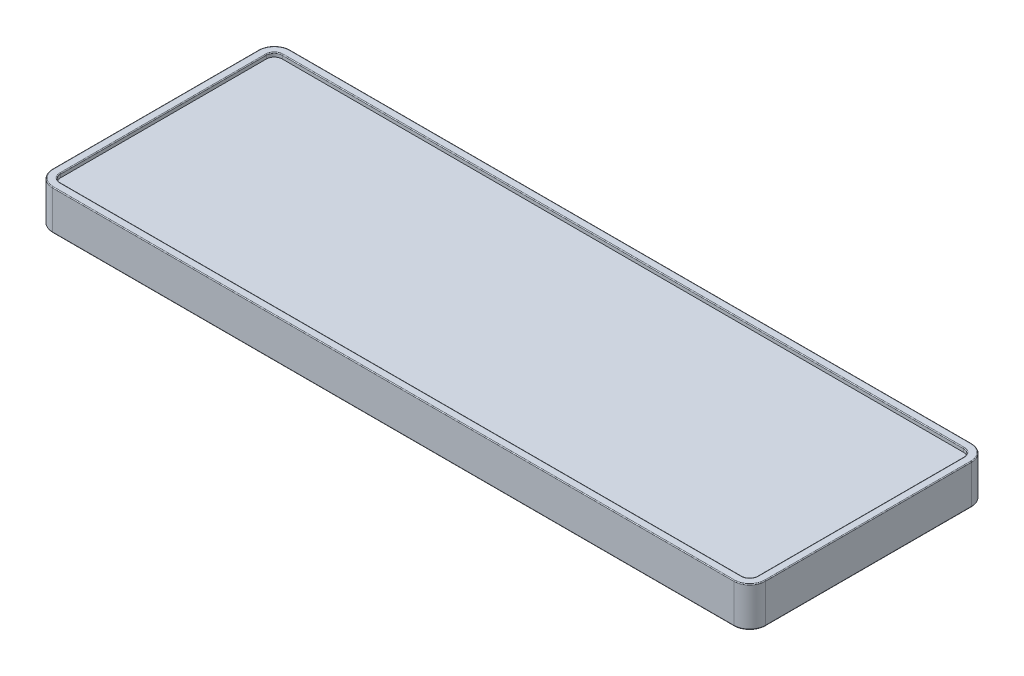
ISO-10303-21;
HEADER;
FILE_DESCRIPTION(('STEP AP214'),'2;1');
FILE_NAME('part.step','',(''),(''),'','','');
FILE_SCHEMA(('AUTOMOTIVE_DESIGN { 1 0 10303 214 1 1 1 1 }'));
ENDSEC;
DATA;
#1=APPLICATION_CONTEXT('core data for automotive mechanical design processes');
#2=APPLICATION_PROTOCOL_DEFINITION('international standard','automotive_design',2000,#1);
#3=PRODUCT_CONTEXT('',#1,'mechanical');
#4=PRODUCT('Part','Part','',(#3));
#5=PRODUCT_RELATED_PRODUCT_CATEGORY('part','',(#4));
#6=PRODUCT_DEFINITION_FORMATION('','',#4);
#7=PRODUCT_DEFINITION_CONTEXT('part definition',#1,'design');
#8=PRODUCT_DEFINITION('design','',#6,#7);
#9=PRODUCT_DEFINITION_SHAPE('','',#8);
#10=(LENGTH_UNIT() NAMED_UNIT(*) SI_UNIT(.MILLI.,.METRE.));
#11=(NAMED_UNIT(*) PLANE_ANGLE_UNIT() SI_UNIT($,.RADIAN.));
#12=(NAMED_UNIT(*) SI_UNIT($,.STERADIAN.) SOLID_ANGLE_UNIT());
#13=UNCERTAINTY_MEASURE_WITH_UNIT(LENGTH_MEASURE(1.E-05),#10,'distance_accuracy_value','');
#14=(GEOMETRIC_REPRESENTATION_CONTEXT(3) GLOBAL_UNCERTAINTY_ASSIGNED_CONTEXT((#13)) GLOBAL_UNIT_ASSIGNED_CONTEXT((#10,
#11,#12)) REPRESENTATION_CONTEXT('',''));
#15=CARTESIAN_POINT('',(0.,0.,0.));
#16=DIRECTION('',(0.,0.,1.));
#17=DIRECTION('',(1.,0.,0.));
#18=AXIS2_PLACEMENT_3D('',#15,#16,#17);
#19=CARTESIAN_POINT('',(-430.,0.,130.));
#20=DIRECTION('',(0.,-1.,0.));
#21=DIRECTION('',(0.,0.,-1.));
#22=AXIS2_PLACEMENT_3D('',#19,#20,#21);
#23=PLANE('',#22);
#24=DIRECTION('',(-1.,0.,0.));
#25=VECTOR('',#24,1.);
#26=CARTESIAN_POINT('',(-430.,0.,-141.));
#27=LINE('',#26,#25);
#28=CARTESIAN_POINT('',(430.,0.,-141.));
#29=VERTEX_POINT('',#28);
#30=CARTESIAN_POINT('',(-430.,0.,-141.));
#31=VERTEX_POINT('',#30);
#32=EDGE_CURVE('E671',#29,#31,#27,.T.);
#33=ORIENTED_EDGE('',*,*,#32,.T.);
#34=CARTESIAN_POINT('',(-430.,0.,-130.));
#35=DIRECTION('',(0.,-1.,0.));
#36=DIRECTION('',(0.,0.,-1.));
#37=AXIS2_PLACEMENT_3D('',#34,#35,#36);
#38=CIRCLE('',#37,11.);
#39=CARTESIAN_POINT('',(-441.,0.,-130.));
#40=VERTEX_POINT('',#39);
#41=EDGE_CURVE('E674',#31,#40,#38,.F.);
#42=ORIENTED_EDGE('',*,*,#41,.T.);
#43=DIRECTION('',(0.,0.,1.));
#44=VECTOR('',#43,1.);
#45=CARTESIAN_POINT('',(-441.,0.,130.));
#46=LINE('',#45,#44);
#47=CARTESIAN_POINT('',(-441.,0.,130.));
#48=VERTEX_POINT('',#47);
#49=EDGE_CURVE('E653',#40,#48,#46,.T.);
#50=ORIENTED_EDGE('',*,*,#49,.T.);
#51=CARTESIAN_POINT('',(-430.,0.,130.));
#52=DIRECTION('',(0.,-1.,0.));
#53=DIRECTION('',(0.,0.,-1.));
#54=AXIS2_PLACEMENT_3D('',#51,#52,#53);
#55=CIRCLE('',#54,11.);
#56=CARTESIAN_POINT('',(-430.,0.,141.));
#57=VERTEX_POINT('',#56);
#58=EDGE_CURVE('E656',#48,#57,#55,.F.);
#59=ORIENTED_EDGE('',*,*,#58,.T.);
#60=DIRECTION('',(1.,0.,0.));
#61=VECTOR('',#60,1.);
#62=CARTESIAN_POINT('',(-430.,0.,141.));
#63=LINE('',#62,#61);
#64=CARTESIAN_POINT('',(430.,0.,141.));
#65=VERTEX_POINT('',#64);
#66=EDGE_CURVE('E659',#57,#65,#63,.T.);
#67=ORIENTED_EDGE('',*,*,#66,.T.);
#68=CARTESIAN_POINT('',(430.,0.,130.));
#69=DIRECTION('',(0.,-1.,0.));
#70=DIRECTION('',(0.,0.,-1.));
#71=AXIS2_PLACEMENT_3D('',#68,#69,#70);
#72=CIRCLE('',#71,11.);
#73=CARTESIAN_POINT('',(441.,0.,130.));
#74=VERTEX_POINT('',#73);
#75=EDGE_CURVE('E662',#65,#74,#72,.F.);
#76=ORIENTED_EDGE('',*,*,#75,.T.);
#77=DIRECTION('',(0.,0.,-1.));
#78=VECTOR('',#77,1.);
#79=CARTESIAN_POINT('',(441.,0.,130.));
#80=LINE('',#79,#78);
#81=CARTESIAN_POINT('',(441.,0.,-130.));
#82=VERTEX_POINT('',#81);
#83=EDGE_CURVE('E665',#74,#82,#80,.T.);
#84=ORIENTED_EDGE('',*,*,#83,.T.);
#85=CARTESIAN_POINT('',(430.,0.,-130.));
#86=DIRECTION('',(0.,-1.,0.));
#87=DIRECTION('',(0.,0.,-1.));
#88=AXIS2_PLACEMENT_3D('',#85,#86,#87);
#89=CIRCLE('',#88,11.);
#90=EDGE_CURVE('E668',#82,#29,#89,.F.);
#91=ORIENTED_EDGE('',*,*,#90,.T.);
#92=EDGE_LOOP('',(#33,#42,#50,#59,#67,#76,#84,#91));
#93=FACE_BOUND('',#92,.T.);
#94=CARTESIAN_POINT('',(430.,0.,130.));
#95=DIRECTION('',(0.,-1.,0.));
#96=DIRECTION('',(0.,0.,-1.));
#97=AXIS2_PLACEMENT_3D('',#94,#95,#96);
#98=CIRCLE('',#97,19.);
#99=CARTESIAN_POINT('',(449.,0.,130.));
#100=VERTEX_POINT('',#99);
#101=CARTESIAN_POINT('',(430.,0.,149.));
#102=VERTEX_POINT('',#101);
#103=EDGE_CURVE('E646',#100,#102,#98,.T.);
#104=ORIENTED_EDGE('',*,*,#103,.T.);
#105=DIRECTION('',(1.,0.,0.));
#106=VECTOR('',#105,1.);
#107=CARTESIAN_POINT('',(-430.,0.,149.));
#108=LINE('',#107,#106);
#109=CARTESIAN_POINT('',(-430.,0.,149.));
#110=VERTEX_POINT('',#109);
#111=EDGE_CURVE('E649',#102,#110,#108,.F.);
#112=ORIENTED_EDGE('',*,*,#111,.T.);
#113=CARTESIAN_POINT('',(-430.,0.,130.));
#114=DIRECTION('',(0.,-1.,0.));
#115=DIRECTION('',(0.,0.,-1.));
#116=AXIS2_PLACEMENT_3D('',#113,#114,#115);
#117=CIRCLE('',#116,19.);
#118=CARTESIAN_POINT('',(-449.,0.,130.));
#119=VERTEX_POINT('',#118);
#120=EDGE_CURVE('E568',#110,#119,#117,.T.);
#121=ORIENTED_EDGE('',*,*,#120,.T.);
#122=DIRECTION('',(0.,0.,1.));
#123=VECTOR('',#122,1.);
#124=CARTESIAN_POINT('',(-449.,0.,-130.));
#125=LINE('',#124,#123);
#126=CARTESIAN_POINT('',(-449.,0.,-130.));
#127=VERTEX_POINT('',#126);
#128=EDGE_CURVE('E631',#119,#127,#125,.F.);
#129=ORIENTED_EDGE('',*,*,#128,.T.);
#130=CARTESIAN_POINT('',(-430.,0.,-130.));
#131=DIRECTION('',(0.,-1.,0.));
#132=DIRECTION('',(0.,0.,-1.));
#133=AXIS2_PLACEMENT_3D('',#130,#131,#132);
#134=CIRCLE('',#133,19.);
#135=CARTESIAN_POINT('',(-430.,0.,-149.));
#136=VERTEX_POINT('',#135);
#137=EDGE_CURVE('E634',#127,#136,#134,.T.);
#138=ORIENTED_EDGE('',*,*,#137,.T.);
#139=DIRECTION('',(-1.,0.,0.));
#140=VECTOR('',#139,1.);
#141=CARTESIAN_POINT('',(430.,0.,-149.));
#142=LINE('',#141,#140);
#143=CARTESIAN_POINT('',(430.,0.,-149.));
#144=VERTEX_POINT('',#143);
#145=EDGE_CURVE('E637',#136,#144,#142,.F.);
#146=ORIENTED_EDGE('',*,*,#145,.T.);
#147=CARTESIAN_POINT('',(430.,0.,-130.));
#148=DIRECTION('',(0.,-1.,0.));
#149=DIRECTION('',(0.,0.,-1.));
#150=AXIS2_PLACEMENT_3D('',#147,#148,#149);
#151=CIRCLE('',#150,19.);
#152=CARTESIAN_POINT('',(449.,0.,-130.));
#153=VERTEX_POINT('',#152);
#154=EDGE_CURVE('E640',#144,#153,#151,.T.);
#155=ORIENTED_EDGE('',*,*,#154,.T.);
#156=DIRECTION('',(0.,0.,-1.));
#157=VECTOR('',#156,1.);
#158=CARTESIAN_POINT('',(449.,0.,130.));
#159=LINE('',#158,#157);
#160=EDGE_CURVE('E643',#153,#100,#159,.F.);
#161=ORIENTED_EDGE('',*,*,#160,.T.);
#162=EDGE_LOOP('',(#104,#112,#121,#129,#138,#146,#155,#161));
#163=FACE_BOUND('',#162,.T.);
#164=ADVANCED_FACE('F39',(#93,#163),#23,.T.);
#165=CARTESIAN_POINT('',(-430.,50.,130.));
#166=DIRECTION('',(0.,-1.,0.));
#167=DIRECTION('',(0.,0.,-1.));
#168=AXIS2_PLACEMENT_3D('',#165,#166,#167);
#169=CYLINDRICAL_SURFACE('',#168,20.);
#170=DIRECTION('',(0.,-1.,0.));
#171=VECTOR('',#170,1.);
#172=CARTESIAN_POINT('',(-450.,50.,130.));
#173=LINE('',#172,#171);
#174=CARTESIAN_POINT('',(-450.,49.,130.));
#175=VERTEX_POINT('',#174);
#176=CARTESIAN_POINT('',(-450.,1.,130.));
#177=VERTEX_POINT('',#176);
#178=EDGE_CURVE('E412',#175,#177,#173,.T.);
#179=ORIENTED_EDGE('',*,*,#178,.T.);
#180=CARTESIAN_POINT('',(-430.,1.,130.));
#181=DIRECTION('',(0.,-1.,0.));
#182=DIRECTION('',(0.,0.,-1.));
#183=AXIS2_PLACEMENT_3D('',#180,#181,#182);
#184=CIRCLE('',#183,20.);
#185=CARTESIAN_POINT('',(-430.,1.,150.));
#186=VERTEX_POINT('',#185);
#187=EDGE_CURVE('E11',#177,#186,#184,.F.);
#188=ORIENTED_EDGE('',*,*,#187,.T.);
#189=DIRECTION('',(0.,-1.,0.));
#190=VECTOR('',#189,1.);
#191=CARTESIAN_POINT('',(-430.,50.,150.));
#192=LINE('',#191,#190);
#193=CARTESIAN_POINT('',(-430.,49.,150.));
#194=VERTEX_POINT('',#193);
#195=EDGE_CURVE('E464',#194,#186,#192,.T.);
#196=ORIENTED_EDGE('',*,*,#195,.F.);
#197=CARTESIAN_POINT('',(-430.,49.,130.));
#198=DIRECTION('',(0.,-1.,0.));
#199=DIRECTION('',(0.,0.,-1.));
#200=AXIS2_PLACEMENT_3D('',#197,#198,#199);
#201=CIRCLE('',#200,20.);
#202=EDGE_CURVE('E540',#194,#175,#201,.T.);
#203=ORIENTED_EDGE('',*,*,#202,.T.);
#204=EDGE_LOOP('',(#179,#188,#196,#203));
#205=FACE_BOUND('',#204,.T.);
#206=ADVANCED_FACE('F803',(#205),#169,.T.);
#207=CARTESIAN_POINT('',(-430.,50.,150.));
#208=DIRECTION('',(0.,0.,-1.));
#209=DIRECTION('',(-1.,0.,0.));
#210=AXIS2_PLACEMENT_3D('',#207,#208,#209);
#211=PLANE('',#210);
#212=ORIENTED_EDGE('',*,*,#195,.T.);
#213=DIRECTION('',(1.,0.,0.));
#214=VECTOR('',#213,1.);
#215=CARTESIAN_POINT('',(430.,1.,150.));
#216=LINE('',#215,#214);
#217=CARTESIAN_POINT('',(430.,1.,150.));
#218=VERTEX_POINT('',#217);
#219=EDGE_CURVE('E702',#186,#218,#216,.T.);
#220=ORIENTED_EDGE('',*,*,#219,.T.);
#221=DIRECTION('',(0.,-1.,0.));
#222=VECTOR('',#221,1.);
#223=CARTESIAN_POINT('',(430.,50.,150.));
#224=LINE('',#223,#222);
#225=CARTESIAN_POINT('',(430.,49.,150.));
#226=VERTEX_POINT('',#225);
#227=EDGE_CURVE('E460',#226,#218,#224,.T.);
#228=ORIENTED_EDGE('',*,*,#227,.F.);
#229=DIRECTION('',(1.,0.,0.));
#230=VECTOR('',#229,1.);
#231=CARTESIAN_POINT('',(-430.,49.,150.));
#232=LINE('',#231,#230);
#233=EDGE_CURVE('E537',#226,#194,#232,.F.);
#234=ORIENTED_EDGE('',*,*,#233,.T.);
#235=EDGE_LOOP('',(#212,#220,#228,#234));
#236=FACE_BOUND('',#235,.T.);
#237=ADVANCED_FACE('F806',(#236),#211,.F.);
#238=CARTESIAN_POINT('',(430.,50.,130.));
#239=DIRECTION('',(0.,-1.,0.));
#240=DIRECTION('',(0.,0.,-1.));
#241=AXIS2_PLACEMENT_3D('',#238,#239,#240);
#242=CYLINDRICAL_SURFACE('',#241,20.);
#243=ORIENTED_EDGE('',*,*,#227,.T.);
#244=CARTESIAN_POINT('',(430.,1.,130.));
#245=DIRECTION('',(0.,-1.,0.));
#246=DIRECTION('',(0.,0.,-1.));
#247=AXIS2_PLACEMENT_3D('',#244,#245,#246);
#248=CIRCLE('',#247,20.);
#249=CARTESIAN_POINT('',(450.,1.,130.));
#250=VERTEX_POINT('',#249);
#251=EDGE_CURVE('E706',#218,#250,#248,.F.);
#252=ORIENTED_EDGE('',*,*,#251,.T.);
#253=DIRECTION('',(0.,-1.,0.));
#254=VECTOR('',#253,1.);
#255=CARTESIAN_POINT('',(450.,50.,130.));
#256=LINE('',#255,#254);
#257=CARTESIAN_POINT('',(450.,49.,130.));
#258=VERTEX_POINT('',#257);
#259=EDGE_CURVE('E456',#258,#250,#256,.T.);
#260=ORIENTED_EDGE('',*,*,#259,.F.);
#261=CARTESIAN_POINT('',(430.,49.,130.));
#262=DIRECTION('',(0.,-1.,0.));
#263=DIRECTION('',(0.,0.,-1.));
#264=AXIS2_PLACEMENT_3D('',#261,#262,#263);
#265=CIRCLE('',#264,20.);
#266=EDGE_CURVE('E534',#258,#226,#265,.T.);
#267=ORIENTED_EDGE('',*,*,#266,.T.);
#268=EDGE_LOOP('',(#243,#252,#260,#267));
#269=FACE_BOUND('',#268,.T.);
#270=ADVANCED_FACE('F861',(#269),#242,.T.);
#271=CARTESIAN_POINT('',(450.,50.,130.));
#272=DIRECTION('',(-1.,0.,0.));
#273=DIRECTION('',(0.,0.,1.));
#274=AXIS2_PLACEMENT_3D('',#271,#272,#273);
#275=PLANE('',#274);
#276=ORIENTED_EDGE('',*,*,#259,.T.);
#277=DIRECTION('',(0.,0.,-1.));
#278=VECTOR('',#277,1.);
#279=CARTESIAN_POINT('',(450.,1.,-130.));
#280=LINE('',#279,#278);
#281=CARTESIAN_POINT('',(450.,1.,-130.));
#282=VERTEX_POINT('',#281);
#283=EDGE_CURVE('E709',#250,#282,#280,.T.);
#284=ORIENTED_EDGE('',*,*,#283,.T.);
#285=DIRECTION('',(0.,-1.,0.));
#286=VECTOR('',#285,1.);
#287=CARTESIAN_POINT('',(450.,50.,-130.));
#288=LINE('',#287,#286);
#289=CARTESIAN_POINT('',(450.,49.,-130.));
#290=VERTEX_POINT('',#289);
#291=EDGE_CURVE('E452',#290,#282,#288,.T.);
#292=ORIENTED_EDGE('',*,*,#291,.F.);
#293=DIRECTION('',(0.,0.,-1.));
#294=VECTOR('',#293,1.);
#295=CARTESIAN_POINT('',(450.,49.,130.));
#296=LINE('',#295,#294);
#297=EDGE_CURVE('E531',#290,#258,#296,.F.);
#298=ORIENTED_EDGE('',*,*,#297,.T.);
#299=EDGE_LOOP('',(#276,#284,#292,#298));
#300=FACE_BOUND('',#299,.T.);
#301=ADVANCED_FACE('F849',(#300),#275,.F.);
#302=CARTESIAN_POINT('',(430.,50.,-130.));
#303=DIRECTION('',(0.,-1.,0.));
#304=DIRECTION('',(0.,0.,-1.));
#305=AXIS2_PLACEMENT_3D('',#302,#303,#304);
#306=CYLINDRICAL_SURFACE('',#305,20.);
#307=ORIENTED_EDGE('',*,*,#291,.T.);
#308=CARTESIAN_POINT('',(430.,1.,-130.));
#309=DIRECTION('',(0.,-1.,0.));
#310=DIRECTION('',(0.,0.,-1.));
#311=AXIS2_PLACEMENT_3D('',#308,#309,#310);
#312=CIRCLE('',#311,20.);
#313=CARTESIAN_POINT('',(430.,1.,-150.));
#314=VERTEX_POINT('',#313);
#315=EDGE_CURVE('E712',#282,#314,#312,.F.);
#316=ORIENTED_EDGE('',*,*,#315,.T.);
#317=DIRECTION('',(0.,-1.,0.));
#318=VECTOR('',#317,1.);
#319=CARTESIAN_POINT('',(430.,50.,-150.));
#320=LINE('',#319,#318);
#321=CARTESIAN_POINT('',(430.,49.,-150.));
#322=VERTEX_POINT('',#321);
#323=EDGE_CURVE('E448',#322,#314,#320,.T.);
#324=ORIENTED_EDGE('',*,*,#323,.F.);
#325=CARTESIAN_POINT('',(430.,49.,-130.));
#326=DIRECTION('',(0.,-1.,0.));
#327=DIRECTION('',(0.,0.,-1.));
#328=AXIS2_PLACEMENT_3D('',#325,#326,#327);
#329=CIRCLE('',#328,20.);
#330=EDGE_CURVE('E528',#322,#290,#329,.T.);
#331=ORIENTED_EDGE('',*,*,#330,.T.);
#332=EDGE_LOOP('',(#307,#316,#324,#331));
#333=FACE_BOUND('',#332,.T.);
#334=ADVANCED_FACE('F846',(#333),#306,.T.);
#335=CARTESIAN_POINT('',(-430.,50.,-150.));
#336=DIRECTION('',(0.,0.,1.));
#337=DIRECTION('',(1.,0.,0.));
#338=AXIS2_PLACEMENT_3D('',#335,#336,#337);
#339=PLANE('',#338);
#340=ORIENTED_EDGE('',*,*,#323,.T.);
#341=DIRECTION('',(-1.,0.,0.));
#342=VECTOR('',#341,1.);
#343=CARTESIAN_POINT('',(-430.,1.,-150.));
#344=LINE('',#343,#342);
#345=CARTESIAN_POINT('',(-430.,1.,-150.));
#346=VERTEX_POINT('',#345);
#347=EDGE_CURVE('E715',#314,#346,#344,.T.);
#348=ORIENTED_EDGE('',*,*,#347,.T.);
#349=DIRECTION('',(0.,-1.,0.));
#350=VECTOR('',#349,1.);
#351=CARTESIAN_POINT('',(-430.,50.,-150.));
#352=LINE('',#351,#350);
#353=CARTESIAN_POINT('',(-430.,49.,-150.));
#354=VERTEX_POINT('',#353);
#355=EDGE_CURVE('E445',#354,#346,#352,.T.);
#356=ORIENTED_EDGE('',*,*,#355,.F.);
#357=DIRECTION('',(-1.,0.,0.));
#358=VECTOR('',#357,1.);
#359=CARTESIAN_POINT('',(-430.,49.,-150.));
#360=LINE('',#359,#358);
#361=EDGE_CURVE('E525',#354,#322,#360,.F.);
#362=ORIENTED_EDGE('',*,*,#361,.T.);
#363=EDGE_LOOP('',(#340,#348,#356,#362));
#364=FACE_BOUND('',#363,.T.);
#365=ADVANCED_FACE('F833',(#364),#339,.F.);
#366=CARTESIAN_POINT('',(-430.,50.,-130.));
#367=DIRECTION('',(0.,-1.,0.));
#368=DIRECTION('',(0.,0.,-1.));
#369=AXIS2_PLACEMENT_3D('',#366,#367,#368);
#370=CYLINDRICAL_SURFACE('',#369,20.);
#371=ORIENTED_EDGE('',*,*,#355,.T.);
#372=CARTESIAN_POINT('',(-430.,1.,-130.));
#373=DIRECTION('',(0.,-1.,0.));
#374=DIRECTION('',(0.,0.,-1.));
#375=AXIS2_PLACEMENT_3D('',#372,#373,#374);
#376=CIRCLE('',#375,20.);
#377=CARTESIAN_POINT('',(-450.,1.,-130.));
#378=VERTEX_POINT('',#377);
#379=EDGE_CURVE('E64',#346,#378,#376,.F.);
#380=ORIENTED_EDGE('',*,*,#379,.T.);
#381=DIRECTION('',(0.,-1.,0.));
#382=VECTOR('',#381,1.);
#383=CARTESIAN_POINT('',(-450.,50.,-130.));
#384=LINE('',#383,#382);
#385=CARTESIAN_POINT('',(-450.,49.,-130.));
#386=VERTEX_POINT('',#385);
#387=EDGE_CURVE('E442',#386,#378,#384,.T.);
#388=ORIENTED_EDGE('',*,*,#387,.F.);
#389=CARTESIAN_POINT('',(-430.,49.,-130.));
#390=DIRECTION('',(0.,-1.,0.));
#391=DIRECTION('',(0.,0.,-1.));
#392=AXIS2_PLACEMENT_3D('',#389,#390,#391);
#393=CIRCLE('',#392,20.);
#394=EDGE_CURVE('E522',#386,#354,#393,.T.);
#395=ORIENTED_EDGE('',*,*,#394,.T.);
#396=EDGE_LOOP('',(#371,#380,#388,#395));
#397=FACE_BOUND('',#396,.T.);
#398=ADVANCED_FACE('F830',(#397),#370,.T.);
#399=CARTESIAN_POINT('',(-450.,50.,130.));
#400=DIRECTION('',(1.,0.,0.));
#401=DIRECTION('',(0.,0.,-1.));
#402=AXIS2_PLACEMENT_3D('',#399,#400,#401);
#403=PLANE('',#402);
#404=ORIENTED_EDGE('',*,*,#387,.T.);
#405=DIRECTION('',(0.,0.,1.));
#406=VECTOR('',#405,1.);
#407=CARTESIAN_POINT('',(-450.,1.,130.));
#408=LINE('',#407,#406);
#409=EDGE_CURVE('E49',#378,#177,#408,.T.);
#410=ORIENTED_EDGE('',*,*,#409,.T.);
#411=ORIENTED_EDGE('',*,*,#178,.F.);
#412=DIRECTION('',(0.,0.,1.));
#413=VECTOR('',#412,1.);
#414=CARTESIAN_POINT('',(-450.,49.,130.));
#415=LINE('',#414,#413);
#416=EDGE_CURVE('E518',#175,#386,#415,.F.);
#417=ORIENTED_EDGE('',*,*,#416,.T.);
#418=EDGE_LOOP('',(#404,#410,#411,#417));
#419=FACE_BOUND('',#418,.T.);
#420=ADVANCED_FACE('F819',(#419),#403,.F.);
#421=CARTESIAN_POINT('',(-430.,50.,130.));
#422=DIRECTION('',(0.,-1.,0.));
#423=DIRECTION('',(0.,0.,-1.));
#424=AXIS2_PLACEMENT_3D('',#421,#422,#423);
#425=PLANE('',#424);
#426=CARTESIAN_POINT('',(-430.,50.,-130.));
#427=DIRECTION('',(0.,-1.,0.));
#428=DIRECTION('',(0.,0.,-1.));
#429=AXIS2_PLACEMENT_3D('',#426,#427,#428);
#430=CIRCLE('',#429,19.);
#431=CARTESIAN_POINT('',(-430.,50.,-149.));
#432=VERTEX_POINT('',#431);
#433=CARTESIAN_POINT('',(-449.,50.,-130.));
#434=VERTEX_POINT('',#433);
#435=EDGE_CURVE('E511',#432,#434,#430,.F.);
#436=ORIENTED_EDGE('',*,*,#435,.T.);
#437=DIRECTION('',(0.,0.,1.));
#438=VECTOR('',#437,1.);
#439=CARTESIAN_POINT('',(-449.,50.,130.));
#440=LINE('',#439,#438);
#441=CARTESIAN_POINT('',(-449.,50.,130.));
#442=VERTEX_POINT('',#441);
#443=EDGE_CURVE('E514',#434,#442,#440,.T.);
#444=ORIENTED_EDGE('',*,*,#443,.T.);
#445=CARTESIAN_POINT('',(-430.,50.,130.));
#446=DIRECTION('',(0.,-1.,0.));
#447=DIRECTION('',(0.,0.,-1.));
#448=AXIS2_PLACEMENT_3D('',#445,#446,#447);
#449=CIRCLE('',#448,19.);
#450=CARTESIAN_POINT('',(-430.,50.,149.));
#451=VERTEX_POINT('',#450);
#452=EDGE_CURVE('E493',#442,#451,#449,.F.);
#453=ORIENTED_EDGE('',*,*,#452,.T.);
#454=DIRECTION('',(1.,0.,0.));
#455=VECTOR('',#454,1.);
#456=CARTESIAN_POINT('',(-430.,50.,149.));
#457=LINE('',#456,#455);
#458=CARTESIAN_POINT('',(430.,50.,149.));
#459=VERTEX_POINT('',#458);
#460=EDGE_CURVE('E496',#451,#459,#457,.T.);
#461=ORIENTED_EDGE('',*,*,#460,.T.);
#462=CARTESIAN_POINT('',(430.,50.,130.));
#463=DIRECTION('',(0.,-1.,0.));
#464=DIRECTION('',(0.,0.,-1.));
#465=AXIS2_PLACEMENT_3D('',#462,#463,#464);
#466=CIRCLE('',#465,19.);
#467=CARTESIAN_POINT('',(449.,50.,130.));
#468=VERTEX_POINT('',#467);
#469=EDGE_CURVE('E499',#459,#468,#466,.F.);
#470=ORIENTED_EDGE('',*,*,#469,.T.);
#471=DIRECTION('',(0.,0.,-1.));
#472=VECTOR('',#471,1.);
#473=CARTESIAN_POINT('',(449.,50.,130.));
#474=LINE('',#473,#472);
#475=CARTESIAN_POINT('',(449.,50.,-130.));
#476=VERTEX_POINT('',#475);
#477=EDGE_CURVE('E502',#468,#476,#474,.T.);
#478=ORIENTED_EDGE('',*,*,#477,.T.);
#479=CARTESIAN_POINT('',(430.,50.,-130.));
#480=DIRECTION('',(0.,-1.,0.));
#481=DIRECTION('',(0.,0.,-1.));
#482=AXIS2_PLACEMENT_3D('',#479,#480,#481);
#483=CIRCLE('',#482,19.);
#484=CARTESIAN_POINT('',(430.,50.,-149.));
#485=VERTEX_POINT('',#484);
#486=EDGE_CURVE('E505',#476,#485,#483,.F.);
#487=ORIENTED_EDGE('',*,*,#486,.T.);
#488=DIRECTION('',(-1.,0.,0.));
#489=VECTOR('',#488,1.);
#490=CARTESIAN_POINT('',(-430.,50.,-149.));
#491=LINE('',#490,#489);
#492=EDGE_CURVE('E508',#485,#432,#491,.T.);
#493=ORIENTED_EDGE('',*,*,#492,.T.);
#494=EDGE_LOOP('',(#436,#444,#453,#461,#470,#478,#487,#493));
#495=FACE_BOUND('',#494,.T.);
#496=DIRECTION('',(0.,0.,-1.));
#497=VECTOR('',#496,1.);
#498=CARTESIAN_POINT('',(441.,50.,130.));
#499=LINE('',#498,#497);
#500=CARTESIAN_POINT('',(441.,50.,-130.));
#501=VERTEX_POINT('',#500);
#502=CARTESIAN_POINT('',(441.,50.,130.));
#503=VERTEX_POINT('',#502);
#504=EDGE_CURVE('E486',#501,#503,#499,.F.);
#505=ORIENTED_EDGE('',*,*,#504,.T.);
#506=CARTESIAN_POINT('',(430.,50.,130.));
#507=DIRECTION('',(0.,-1.,0.));
#508=DIRECTION('',(0.,0.,-1.));
#509=AXIS2_PLACEMENT_3D('',#506,#507,#508);
#510=CIRCLE('',#509,11.);
#511=CARTESIAN_POINT('',(430.,50.,141.));
#512=VERTEX_POINT('',#511);
#513=EDGE_CURVE('E489',#503,#512,#510,.T.);
#514=ORIENTED_EDGE('',*,*,#513,.T.);
#515=DIRECTION('',(1.,0.,0.));
#516=VECTOR('',#515,1.);
#517=CARTESIAN_POINT('',(-430.,50.,141.));
#518=LINE('',#517,#516);
#519=CARTESIAN_POINT('',(-430.,50.,141.));
#520=VERTEX_POINT('',#519);
#521=EDGE_CURVE('E468',#512,#520,#518,.F.);
#522=ORIENTED_EDGE('',*,*,#521,.T.);
#523=CARTESIAN_POINT('',(-430.,50.,130.));
#524=DIRECTION('',(0.,-1.,0.));
#525=DIRECTION('',(0.,0.,-1.));
#526=AXIS2_PLACEMENT_3D('',#523,#524,#525);
#527=CIRCLE('',#526,11.);
#528=CARTESIAN_POINT('',(-441.,50.,130.));
#529=VERTEX_POINT('',#528);
#530=EDGE_CURVE('E471',#520,#529,#527,.T.);
#531=ORIENTED_EDGE('',*,*,#530,.T.);
#532=DIRECTION('',(0.,0.,1.));
#533=VECTOR('',#532,1.);
#534=CARTESIAN_POINT('',(-441.,50.,130.));
#535=LINE('',#534,#533);
#536=CARTESIAN_POINT('',(-441.,50.,-130.));
#537=VERTEX_POINT('',#536);
#538=EDGE_CURVE('E474',#529,#537,#535,.F.);
#539=ORIENTED_EDGE('',*,*,#538,.T.);
#540=CARTESIAN_POINT('',(-430.,50.,-130.));
#541=DIRECTION('',(0.,-1.,0.));
#542=DIRECTION('',(0.,0.,-1.));
#543=AXIS2_PLACEMENT_3D('',#540,#541,#542);
#544=CIRCLE('',#543,11.);
#545=CARTESIAN_POINT('',(-430.,50.,-141.));
#546=VERTEX_POINT('',#545);
#547=EDGE_CURVE('E477',#537,#546,#544,.T.);
#548=ORIENTED_EDGE('',*,*,#547,.T.);
#549=DIRECTION('',(-1.,0.,0.));
#550=VECTOR('',#549,1.);
#551=CARTESIAN_POINT('',(-430.,50.,-141.));
#552=LINE('',#551,#550);
#553=CARTESIAN_POINT('',(430.,50.,-141.));
#554=VERTEX_POINT('',#553);
#555=EDGE_CURVE('E480',#546,#554,#552,.F.);
#556=ORIENTED_EDGE('',*,*,#555,.T.);
#557=CARTESIAN_POINT('',(430.,50.,-130.));
#558=DIRECTION('',(0.,-1.,0.));
#559=DIRECTION('',(0.,0.,-1.));
#560=AXIS2_PLACEMENT_3D('',#557,#558,#559);
#561=CIRCLE('',#560,11.);
#562=EDGE_CURVE('E483',#554,#501,#561,.T.);
#563=ORIENTED_EDGE('',*,*,#562,.T.);
#564=EDGE_LOOP('',(#505,#514,#522,#531,#539,#548,#556,#563));
#565=FACE_BOUND('',#564,.T.);
#566=ADVANCED_FACE('F890',(#495,#565),#425,.F.);
#567=CARTESIAN_POINT('',(-430.,45.,130.));
#568=DIRECTION('',(0.,1.,0.));
#569=DIRECTION('',(0.,0.,1.));
#570=AXIS2_PLACEMENT_3D('',#567,#568,#569);
#571=CYLINDRICAL_SURFACE('',#570,10.);
#572=DIRECTION('',(0.,1.,0.));
#573=VECTOR('',#572,1.);
#574=CARTESIAN_POINT('',(-440.,45.,130.));
#575=LINE('',#574,#573);
#576=CARTESIAN_POINT('',(-440.,45.,130.));
#577=VERTEX_POINT('',#576);
#578=CARTESIAN_POINT('',(-440.,49.,130.));
#579=VERTEX_POINT('',#578);
#580=EDGE_CURVE('E408',#577,#579,#575,.T.);
#581=ORIENTED_EDGE('',*,*,#580,.T.);
#582=CARTESIAN_POINT('',(-430.,49.,130.));
#583=DIRECTION('',(0.,-1.,0.));
#584=DIRECTION('',(0.,0.,-1.));
#585=AXIS2_PLACEMENT_3D('',#582,#583,#584);
#586=CIRCLE('',#585,10.);
#587=CARTESIAN_POINT('',(-430.,49.,140.));
#588=VERTEX_POINT('',#587);
#589=EDGE_CURVE('E562',#579,#588,#586,.F.);
#590=ORIENTED_EDGE('',*,*,#589,.T.);
#591=DIRECTION('',(0.,1.,0.));
#592=VECTOR('',#591,1.);
#593=CARTESIAN_POINT('',(-430.,45.,140.));
#594=LINE('',#593,#592);
#595=CARTESIAN_POINT('',(-430.,45.,140.));
#596=VERTEX_POINT('',#595);
#597=EDGE_CURVE('E407',#596,#588,#594,.T.);
#598=ORIENTED_EDGE('',*,*,#597,.F.);
#599=CARTESIAN_POINT('',(-430.,45.,130.));
#600=DIRECTION('',(0.,1.,0.));
#601=DIRECTION('',(0.,0.,1.));
#602=AXIS2_PLACEMENT_3D('',#599,#600,#601);
#603=CIRCLE('',#602,10.);
#604=EDGE_CURVE('E375',#577,#596,#603,.T.);
#605=ORIENTED_EDGE('',*,*,#604,.F.);
#606=EDGE_LOOP('',(#581,#590,#598,#605));
#607=FACE_BOUND('',#606,.T.);
#608=ADVANCED_FACE('F1054',(#607),#571,.F.);
#609=CARTESIAN_POINT('',(-440.,45.,-130.));
#610=DIRECTION('',(-1.,0.,0.));
#611=DIRECTION('',(0.,0.,1.));
#612=AXIS2_PLACEMENT_3D('',#609,#610,#611);
#613=PLANE('',#612);
#614=DIRECTION('',(0.,1.,0.));
#615=VECTOR('',#614,1.);
#616=CARTESIAN_POINT('',(-440.,45.,-130.));
#617=LINE('',#616,#615);
#618=CARTESIAN_POINT('',(-440.,45.,-130.));
#619=VERTEX_POINT('',#618);
#620=CARTESIAN_POINT('',(-440.,49.,-130.));
#621=VERTEX_POINT('',#620);
#622=EDGE_CURVE('E413',#619,#621,#617,.T.);
#623=ORIENTED_EDGE('',*,*,#622,.T.);
#624=DIRECTION('',(0.,0.,1.));
#625=VECTOR('',#624,1.);
#626=CARTESIAN_POINT('',(-440.,49.,-130.));
#627=LINE('',#626,#625);
#628=EDGE_CURVE('E559',#621,#579,#627,.T.);
#629=ORIENTED_EDGE('',*,*,#628,.T.);
#630=ORIENTED_EDGE('',*,*,#580,.F.);
#631=DIRECTION('',(0.,0.,1.));
#632=VECTOR('',#631,1.);
#633=CARTESIAN_POINT('',(-440.,45.,-130.));
#634=LINE('',#633,#632);
#635=EDGE_CURVE('E403',#619,#577,#634,.T.);
#636=ORIENTED_EDGE('',*,*,#635,.F.);
#637=EDGE_LOOP('',(#623,#629,#630,#636));
#638=FACE_BOUND('',#637,.T.);
#639=ADVANCED_FACE('F1050',(#638),#613,.F.);
#640=CARTESIAN_POINT('',(-430.,45.,-130.));
#641=DIRECTION('',(0.,1.,0.));
#642=DIRECTION('',(0.,0.,1.));
#643=AXIS2_PLACEMENT_3D('',#640,#641,#642);
#644=CYLINDRICAL_SURFACE('',#643,9.99999999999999);
#645=DIRECTION('',(0.,1.,0.));
#646=VECTOR('',#645,1.);
#647=CARTESIAN_POINT('',(-430.,45.,-140.));
#648=LINE('',#647,#646);
#649=CARTESIAN_POINT('',(-430.,45.,-140.));
#650=VERTEX_POINT('',#649);
#651=CARTESIAN_POINT('',(-430.,49.,-140.));
#652=VERTEX_POINT('',#651);
#653=EDGE_CURVE('E417',#650,#652,#648,.T.);
#654=ORIENTED_EDGE('',*,*,#653,.T.);
#655=CARTESIAN_POINT('',(-430.,49.,-130.));
#656=DIRECTION('',(0.,-1.,0.));
#657=DIRECTION('',(0.,0.,-1.));
#658=AXIS2_PLACEMENT_3D('',#655,#656,#657);
#659=CIRCLE('',#658,9.99999999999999);
#660=EDGE_CURVE('E556',#652,#621,#659,.F.);
#661=ORIENTED_EDGE('',*,*,#660,.T.);
#662=ORIENTED_EDGE('',*,*,#622,.F.);
#663=CARTESIAN_POINT('',(-430.,45.,-130.));
#664=DIRECTION('',(0.,1.,0.));
#665=DIRECTION('',(0.,0.,1.));
#666=AXIS2_PLACEMENT_3D('',#663,#664,#665);
#667=CIRCLE('',#666,9.99999999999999);
#668=EDGE_CURVE('E399',#650,#619,#667,.T.);
#669=ORIENTED_EDGE('',*,*,#668,.F.);
#670=EDGE_LOOP('',(#654,#661,#662,#669));
#671=FACE_BOUND('',#670,.T.);
#672=ADVANCED_FACE('F1053',(#671),#644,.F.);
#673=CARTESIAN_POINT('',(430.,45.,-140.));
#674=DIRECTION('',(0.,0.,-1.));
#675=DIRECTION('',(-1.,0.,0.));
#676=AXIS2_PLACEMENT_3D('',#673,#674,#675);
#677=PLANE('',#676);
#678=DIRECTION('',(0.,1.,0.));
#679=VECTOR('',#678,1.);
#680=CARTESIAN_POINT('',(430.,45.,-140.));
#681=LINE('',#680,#679);
#682=CARTESIAN_POINT('',(430.,45.,-140.));
#683=VERTEX_POINT('',#682);
#684=CARTESIAN_POINT('',(430.,49.,-140.));
#685=VERTEX_POINT('',#684);
#686=EDGE_CURVE('E421',#683,#685,#681,.T.);
#687=ORIENTED_EDGE('',*,*,#686,.T.);
#688=DIRECTION('',(-1.,0.,0.));
#689=VECTOR('',#688,1.);
#690=CARTESIAN_POINT('',(430.,49.,-140.));
#691=LINE('',#690,#689);
#692=EDGE_CURVE('E553',#685,#652,#691,.T.);
#693=ORIENTED_EDGE('',*,*,#692,.T.);
#694=ORIENTED_EDGE('',*,*,#653,.F.);
#695=DIRECTION('',(-1.,0.,0.));
#696=VECTOR('',#695,1.);
#697=CARTESIAN_POINT('',(430.,45.,-140.));
#698=LINE('',#697,#696);
#699=EDGE_CURVE('E395',#683,#650,#698,.T.);
#700=ORIENTED_EDGE('',*,*,#699,.F.);
#701=EDGE_LOOP('',(#687,#693,#694,#700));
#702=FACE_BOUND('',#701,.T.);
#703=ADVANCED_FACE('F1058',(#702),#677,.F.);
#704=CARTESIAN_POINT('',(430.,45.,-130.));
#705=DIRECTION('',(0.,1.,0.));
#706=DIRECTION('',(0.,0.,1.));
#707=AXIS2_PLACEMENT_3D('',#704,#705,#706);
#708=CYLINDRICAL_SURFACE('',#707,10.);
#709=DIRECTION('',(0.,1.,0.));
#710=VECTOR('',#709,1.);
#711=CARTESIAN_POINT('',(440.,45.,-130.));
#712=LINE('',#711,#710);
#713=CARTESIAN_POINT('',(440.,45.,-130.));
#714=VERTEX_POINT('',#713);
#715=CARTESIAN_POINT('',(440.,49.,-130.));
#716=VERTEX_POINT('',#715);
#717=EDGE_CURVE('E425',#714,#716,#712,.T.);
#718=ORIENTED_EDGE('',*,*,#717,.T.);
#719=CARTESIAN_POINT('',(430.,49.,-130.));
#720=DIRECTION('',(0.,-1.,0.));
#721=DIRECTION('',(0.,0.,-1.));
#722=AXIS2_PLACEMENT_3D('',#719,#720,#721);
#723=CIRCLE('',#722,10.);
#724=EDGE_CURVE('E550',#716,#685,#723,.F.);
#725=ORIENTED_EDGE('',*,*,#724,.T.);
#726=ORIENTED_EDGE('',*,*,#686,.F.);
#727=CARTESIAN_POINT('',(430.,45.,-130.));
#728=DIRECTION('',(0.,1.,0.));
#729=DIRECTION('',(0.,0.,1.));
#730=AXIS2_PLACEMENT_3D('',#727,#728,#729);
#731=CIRCLE('',#730,10.);
#732=EDGE_CURVE('E391',#714,#683,#731,.T.);
#733=ORIENTED_EDGE('',*,*,#732,.F.);
#734=EDGE_LOOP('',(#718,#725,#726,#733));
#735=FACE_BOUND('',#734,.T.);
#736=ADVANCED_FACE('F1062',(#735),#708,.F.);
#737=CARTESIAN_POINT('',(440.,45.,130.));
#738=DIRECTION('',(1.,0.,0.));
#739=DIRECTION('',(0.,0.,-1.));
#740=AXIS2_PLACEMENT_3D('',#737,#738,#739);
#741=PLANE('',#740);
#742=DIRECTION('',(0.,1.,0.));
#743=VECTOR('',#742,1.);
#744=CARTESIAN_POINT('',(440.,45.,130.));
#745=LINE('',#744,#743);
#746=CARTESIAN_POINT('',(440.,45.,130.));
#747=VERTEX_POINT('',#746);
#748=CARTESIAN_POINT('',(440.,49.,130.));
#749=VERTEX_POINT('',#748);
#750=EDGE_CURVE('E429',#747,#749,#745,.T.);
#751=ORIENTED_EDGE('',*,*,#750,.T.);
#752=DIRECTION('',(0.,0.,-1.));
#753=VECTOR('',#752,1.);
#754=CARTESIAN_POINT('',(440.,49.,130.));
#755=LINE('',#754,#753);
#756=EDGE_CURVE('E547',#749,#716,#755,.T.);
#757=ORIENTED_EDGE('',*,*,#756,.T.);
#758=ORIENTED_EDGE('',*,*,#717,.F.);
#759=DIRECTION('',(0.,0.,-1.));
#760=VECTOR('',#759,1.);
#761=CARTESIAN_POINT('',(440.,45.,130.));
#762=LINE('',#761,#760);
#763=EDGE_CURVE('E387',#747,#714,#762,.T.);
#764=ORIENTED_EDGE('',*,*,#763,.F.);
#765=EDGE_LOOP('',(#751,#757,#758,#764));
#766=FACE_BOUND('',#765,.T.);
#767=ADVANCED_FACE('F1066',(#766),#741,.F.);
#768=CARTESIAN_POINT('',(430.,45.,130.));
#769=DIRECTION('',(0.,1.,0.));
#770=DIRECTION('',(0.,0.,1.));
#771=AXIS2_PLACEMENT_3D('',#768,#769,#770);
#772=CYLINDRICAL_SURFACE('',#771,9.99999999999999);
#773=DIRECTION('',(0.,1.,0.));
#774=VECTOR('',#773,1.);
#775=CARTESIAN_POINT('',(430.,45.,140.));
#776=LINE('',#775,#774);
#777=CARTESIAN_POINT('',(430.,45.,140.));
#778=VERTEX_POINT('',#777);
#779=CARTESIAN_POINT('',(430.,49.,140.));
#780=VERTEX_POINT('',#779);
#781=EDGE_CURVE('E433',#778,#780,#776,.T.);
#782=ORIENTED_EDGE('',*,*,#781,.T.);
#783=CARTESIAN_POINT('',(430.,49.,130.));
#784=DIRECTION('',(0.,-1.,0.));
#785=DIRECTION('',(0.,0.,-1.));
#786=AXIS2_PLACEMENT_3D('',#783,#784,#785);
#787=CIRCLE('',#786,9.99999999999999);
#788=EDGE_CURVE('E543',#780,#749,#787,.F.);
#789=ORIENTED_EDGE('',*,*,#788,.T.);
#790=ORIENTED_EDGE('',*,*,#750,.F.);
#791=CARTESIAN_POINT('',(430.,45.,130.));
#792=DIRECTION('',(0.,1.,0.));
#793=DIRECTION('',(0.,0.,1.));
#794=AXIS2_PLACEMENT_3D('',#791,#792,#793);
#795=CIRCLE('',#794,9.99999999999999);
#796=EDGE_CURVE('E383',#778,#747,#795,.T.);
#797=ORIENTED_EDGE('',*,*,#796,.F.);
#798=EDGE_LOOP('',(#782,#789,#790,#797));
#799=FACE_BOUND('',#798,.T.);
#800=ADVANCED_FACE('F1070',(#799),#772,.F.);
#801=CARTESIAN_POINT('',(-430.,45.,140.));
#802=DIRECTION('',(0.,0.,1.));
#803=DIRECTION('',(1.,0.,0.));
#804=AXIS2_PLACEMENT_3D('',#801,#802,#803);
#805=PLANE('',#804);
#806=ORIENTED_EDGE('',*,*,#597,.T.);
#807=DIRECTION('',(1.,0.,0.));
#808=VECTOR('',#807,1.);
#809=CARTESIAN_POINT('',(-430.,49.,140.));
#810=LINE('',#809,#808);
#811=EDGE_CURVE('E565',#588,#780,#810,.T.);
#812=ORIENTED_EDGE('',*,*,#811,.T.);
#813=ORIENTED_EDGE('',*,*,#781,.F.);
#814=DIRECTION('',(1.,0.,0.));
#815=VECTOR('',#814,1.);
#816=CARTESIAN_POINT('',(-430.,45.,140.));
#817=LINE('',#816,#815);
#818=EDGE_CURVE('E379',#596,#778,#817,.T.);
#819=ORIENTED_EDGE('',*,*,#818,.F.);
#820=EDGE_LOOP('',(#806,#812,#813,#819));
#821=FACE_BOUND('',#820,.T.);
#822=ADVANCED_FACE('F1048',(#821),#805,.F.);
#823=CARTESIAN_POINT('',(-430.,45.,130.));
#824=DIRECTION('',(0.,1.,0.));
#825=DIRECTION('',(0.,0.,1.));
#826=AXIS2_PLACEMENT_3D('',#823,#824,#825);
#827=PLANE('',#826);
#828=ORIENTED_EDGE('',*,*,#604,.T.);
#829=ORIENTED_EDGE('',*,*,#818,.T.);
#830=ORIENTED_EDGE('',*,*,#796,.T.);
#831=ORIENTED_EDGE('',*,*,#763,.T.);
#832=ORIENTED_EDGE('',*,*,#732,.T.);
#833=ORIENTED_EDGE('',*,*,#699,.T.);
#834=ORIENTED_EDGE('',*,*,#668,.T.);
#835=ORIENTED_EDGE('',*,*,#635,.T.);
#836=EDGE_LOOP('',(#828,#829,#830,#831,#832,#833,#834,#835));
#837=FACE_BOUND('',#836,.T.);
#838=ADVANCED_FACE('F1045',(#837),#827,.T.);
#839=CARTESIAN_POINT('',(-430.,35.,130.));
#840=DIRECTION('',(0.,1.,0.));
#841=DIRECTION('',(0.,0.,1.));
#842=AXIS2_PLACEMENT_3D('',#839,#840,#841);
#843=PLANE('',#842);
#844=CARTESIAN_POINT('',(-430.,35.,-130.));
#845=DIRECTION('',(0.,1.,0.));
#846=DIRECTION('',(0.,0.,1.));
#847=AXIS2_PLACEMENT_3D('',#844,#845,#846);
#848=CIRCLE('',#847,10.);
#849=CARTESIAN_POINT('',(-430.,35.,-140.));
#850=VERTEX_POINT('',#849);
#851=CARTESIAN_POINT('',(-440.,35.,-130.));
#852=VERTEX_POINT('',#851);
#853=EDGE_CURVE('E368',#850,#852,#848,.T.);
#854=ORIENTED_EDGE('',*,*,#853,.F.);
#855=DIRECTION('',(-1.,0.,0.));
#856=VECTOR('',#855,1.);
#857=CARTESIAN_POINT('',(-430.,35.,-140.));
#858=LINE('',#857,#856);
#859=CARTESIAN_POINT('',(430.,35.,-140.));
#860=VERTEX_POINT('',#859);
#861=EDGE_CURVE('E364',#860,#850,#858,.T.);
#862=ORIENTED_EDGE('',*,*,#861,.F.);
#863=CARTESIAN_POINT('',(430.,35.,-130.));
#864=DIRECTION('',(0.,1.,0.));
#865=DIRECTION('',(0.,0.,1.));
#866=AXIS2_PLACEMENT_3D('',#863,#864,#865);
#867=CIRCLE('',#866,10.);
#868=CARTESIAN_POINT('',(440.,35.,-130.));
#869=VERTEX_POINT('',#868);
#870=EDGE_CURVE('E360',#869,#860,#867,.T.);
#871=ORIENTED_EDGE('',*,*,#870,.F.);
#872=DIRECTION('',(0.,0.,-1.));
#873=VECTOR('',#872,1.);
#874=CARTESIAN_POINT('',(440.,35.,130.));
#875=LINE('',#874,#873);
#876=CARTESIAN_POINT('',(440.,35.,130.));
#877=VERTEX_POINT('',#876);
#878=EDGE_CURVE('E356',#877,#869,#875,.T.);
#879=ORIENTED_EDGE('',*,*,#878,.F.);
#880=CARTESIAN_POINT('',(430.,35.,130.));
#881=DIRECTION('',(0.,1.,0.));
#882=DIRECTION('',(0.,0.,1.));
#883=AXIS2_PLACEMENT_3D('',#880,#881,#882);
#884=CIRCLE('',#883,10.);
#885=CARTESIAN_POINT('',(430.,35.,140.));
#886=VERTEX_POINT('',#885);
#887=EDGE_CURVE('E306',#886,#877,#884,.T.);
#888=ORIENTED_EDGE('',*,*,#887,.F.);
#889=DIRECTION('',(1.,0.,0.));
#890=VECTOR('',#889,1.);
#891=CARTESIAN_POINT('',(-430.,35.,140.));
#892=LINE('',#891,#890);
#893=CARTESIAN_POINT('',(-430.,35.,140.));
#894=VERTEX_POINT('',#893);
#895=EDGE_CURVE('E300',#894,#886,#892,.T.);
#896=ORIENTED_EDGE('',*,*,#895,.F.);
#897=CARTESIAN_POINT('',(-430.,35.,130.));
#898=DIRECTION('',(0.,1.,0.));
#899=DIRECTION('',(0.,0.,1.));
#900=AXIS2_PLACEMENT_3D('',#897,#898,#899);
#901=CIRCLE('',#900,10.);
#902=CARTESIAN_POINT('',(-440.,35.,130.));
#903=VERTEX_POINT('',#902);
#904=EDGE_CURVE('E303',#903,#894,#901,.T.);
#905=ORIENTED_EDGE('',*,*,#904,.F.);
#906=DIRECTION('',(0.,0.,1.));
#907=VECTOR('',#906,1.);
#908=CARTESIAN_POINT('',(-440.,35.,130.));
#909=LINE('',#908,#907);
#910=EDGE_CURVE('E372',#852,#903,#909,.T.);
#911=ORIENTED_EDGE('',*,*,#910,.F.);
#912=EDGE_LOOP('',(#854,#862,#871,#879,#888,#896,#905,#911));
#913=FACE_BOUND('',#912,.T.);
#914=ADVANCED_FACE('F302',(#913),#843,.F.);
#915=CARTESIAN_POINT('',(-430.,50.,130.));
#916=DIRECTION('',(0.,-1.,0.));
#917=DIRECTION('',(0.,0.,-1.));
#918=AXIS2_PLACEMENT_3D('',#915,#916,#917);
#919=CYLINDRICAL_SURFACE('',#918,10.);
#920=DIRECTION('',(0.,1.,0.));
#921=VECTOR('',#920,1.);
#922=CARTESIAN_POINT('',(-430.,50.,140.));
#923=LINE('',#922,#921);
#924=CARTESIAN_POINT('',(-430.,1.,140.));
#925=VERTEX_POINT('',#924);
#926=EDGE_CURVE('E316',#894,#925,#923,.F.);
#927=ORIENTED_EDGE('',*,*,#926,.T.);
#928=CARTESIAN_POINT('',(-430.,1.,130.));
#929=DIRECTION('',(0.,-1.,0.));
#930=DIRECTION('',(0.,0.,-1.));
#931=AXIS2_PLACEMENT_3D('',#928,#929,#930);
#932=CIRCLE('',#931,10.);
#933=CARTESIAN_POINT('',(-440.,1.,130.));
#934=VERTEX_POINT('',#933);
#935=EDGE_CURVE('E696',#925,#934,#932,.T.);
#936=ORIENTED_EDGE('',*,*,#935,.T.);
#937=DIRECTION('',(0.,-1.,0.));
#938=VECTOR('',#937,1.);
#939=CARTESIAN_POINT('',(-440.,50.,130.));
#940=LINE('',#939,#938);
#941=EDGE_CURVE('E319',#903,#934,#940,.T.);
#942=ORIENTED_EDGE('',*,*,#941,.F.);
#943=ORIENTED_EDGE('',*,*,#904,.T.);
#944=EDGE_LOOP('',(#927,#936,#942,#943));
#945=FACE_BOUND('',#944,.T.);
#946=ADVANCED_FACE('F315',(#945),#919,.F.);
#947=CARTESIAN_POINT('',(-430.,50.,140.));
#948=DIRECTION('',(0.,0.,-1.));
#949=DIRECTION('',(-1.,0.,0.));
#950=AXIS2_PLACEMENT_3D('',#947,#948,#949);
#951=PLANE('',#950);
#952=DIRECTION('',(0.,-1.,0.));
#953=VECTOR('',#952,1.);
#954=CARTESIAN_POINT('',(430.,50.,140.));
#955=LINE('',#954,#953);
#956=CARTESIAN_POINT('',(430.,1.,140.));
#957=VERTEX_POINT('',#956);
#958=EDGE_CURVE('E326',#886,#957,#955,.T.);
#959=ORIENTED_EDGE('',*,*,#958,.T.);
#960=DIRECTION('',(1.,0.,0.));
#961=VECTOR('',#960,1.);
#962=CARTESIAN_POINT('',(-430.,1.,140.));
#963=LINE('',#962,#961);
#964=EDGE_CURVE('E324',#957,#925,#963,.F.);
#965=ORIENTED_EDGE('',*,*,#964,.T.);
#966=ORIENTED_EDGE('',*,*,#926,.F.);
#967=ORIENTED_EDGE('',*,*,#895,.T.);
#968=EDGE_LOOP('',(#959,#965,#966,#967));
#969=FACE_BOUND('',#968,.T.);
#970=ADVANCED_FACE('F322',(#969),#951,.T.);
#971=CARTESIAN_POINT('',(430.,50.,130.));
#972=DIRECTION('',(0.,-1.,0.));
#973=DIRECTION('',(0.,0.,-1.));
#974=AXIS2_PLACEMENT_3D('',#971,#972,#973);
#975=CYLINDRICAL_SURFACE('',#974,10.);
#976=DIRECTION('',(0.,1.,0.));
#977=VECTOR('',#976,1.);
#978=CARTESIAN_POINT('',(440.,50.,130.));
#979=LINE('',#978,#977);
#980=CARTESIAN_POINT('',(440.,1.,130.));
#981=VERTEX_POINT('',#980);
#982=EDGE_CURVE('E329',#877,#981,#979,.F.);
#983=ORIENTED_EDGE('',*,*,#982,.T.);
#984=CARTESIAN_POINT('',(430.,1.,130.));
#985=DIRECTION('',(0.,-1.,0.));
#986=DIRECTION('',(0.,0.,-1.));
#987=AXIS2_PLACEMENT_3D('',#984,#985,#986);
#988=CIRCLE('',#987,10.);
#989=EDGE_CURVE('E691',#981,#957,#988,.T.);
#990=ORIENTED_EDGE('',*,*,#989,.T.);
#991=ORIENTED_EDGE('',*,*,#958,.F.);
#992=ORIENTED_EDGE('',*,*,#887,.T.);
#993=EDGE_LOOP('',(#983,#990,#991,#992));
#994=FACE_BOUND('',#993,.T.);
#995=ADVANCED_FACE('F1024',(#994),#975,.F.);
#996=CARTESIAN_POINT('',(440.,50.,130.));
#997=DIRECTION('',(-1.,0.,0.));
#998=DIRECTION('',(0.,0.,1.));
#999=AXIS2_PLACEMENT_3D('',#996,#997,#998);
#1000=PLANE('',#999);
#1001=DIRECTION('',(0.,-1.,0.));
#1002=VECTOR('',#1001,1.);
#1003=CARTESIAN_POINT('',(440.,50.,-130.));
#1004=LINE('',#1003,#1002);
#1005=CARTESIAN_POINT('',(440.,1.,-130.));
#1006=VERTEX_POINT('',#1005);
#1007=EDGE_CURVE('E339',#869,#1006,#1004,.T.);
#1008=ORIENTED_EDGE('',*,*,#1007,.T.);
#1009=DIRECTION('',(0.,0.,-1.));
#1010=VECTOR('',#1009,1.);
#1011=CARTESIAN_POINT('',(440.,1.,130.));
#1012=LINE('',#1011,#1010);
#1013=EDGE_CURVE('E688',#1006,#981,#1012,.F.);
#1014=ORIENTED_EDGE('',*,*,#1013,.T.);
#1015=ORIENTED_EDGE('',*,*,#982,.F.);
#1016=ORIENTED_EDGE('',*,*,#878,.T.);
#1017=EDGE_LOOP('',(#1008,#1014,#1015,#1016));
#1018=FACE_BOUND('',#1017,.T.);
#1019=ADVANCED_FACE('F1012',(#1018),#1000,.T.);
#1020=CARTESIAN_POINT('',(430.,50.,-130.));
#1021=DIRECTION('',(0.,-1.,0.));
#1022=DIRECTION('',(0.,0.,-1.));
#1023=AXIS2_PLACEMENT_3D('',#1020,#1021,#1022);
#1024=CYLINDRICAL_SURFACE('',#1023,10.);
#1025=DIRECTION('',(0.,1.,0.));
#1026=VECTOR('',#1025,1.);
#1027=CARTESIAN_POINT('',(430.,50.,-140.));
#1028=LINE('',#1027,#1026);
#1029=CARTESIAN_POINT('',(430.,1.,-140.));
#1030=VERTEX_POINT('',#1029);
#1031=EDGE_CURVE('E343',#860,#1030,#1028,.F.);
#1032=ORIENTED_EDGE('',*,*,#1031,.T.);
#1033=CARTESIAN_POINT('',(430.,1.,-130.));
#1034=DIRECTION('',(0.,-1.,0.));
#1035=DIRECTION('',(0.,0.,-1.));
#1036=AXIS2_PLACEMENT_3D('',#1033,#1034,#1035);
#1037=CIRCLE('',#1036,10.);
#1038=EDGE_CURVE('E685',#1030,#1006,#1037,.T.);
#1039=ORIENTED_EDGE('',*,*,#1038,.T.);
#1040=ORIENTED_EDGE('',*,*,#1007,.F.);
#1041=ORIENTED_EDGE('',*,*,#870,.T.);
#1042=EDGE_LOOP('',(#1032,#1039,#1040,#1041));
#1043=FACE_BOUND('',#1042,.T.);
#1044=ADVANCED_FACE('F1008',(#1043),#1024,.F.);
#1045=CARTESIAN_POINT('',(-430.,50.,-140.));
#1046=DIRECTION('',(0.,0.,1.));
#1047=DIRECTION('',(1.,0.,0.));
#1048=AXIS2_PLACEMENT_3D('',#1045,#1046,#1047);
#1049=PLANE('',#1048);
#1050=DIRECTION('',(0.,-1.,0.));
#1051=VECTOR('',#1050,1.);
#1052=CARTESIAN_POINT('',(-430.,50.,-140.));
#1053=LINE('',#1052,#1051);
#1054=CARTESIAN_POINT('',(-430.,1.,-140.));
#1055=VERTEX_POINT('',#1054);
#1056=EDGE_CURVE('E347',#850,#1055,#1053,.T.);
#1057=ORIENTED_EDGE('',*,*,#1056,.T.);
#1058=DIRECTION('',(-1.,0.,0.));
#1059=VECTOR('',#1058,1.);
#1060=CARTESIAN_POINT('',(-430.,1.,-140.));
#1061=LINE('',#1060,#1059);
#1062=EDGE_CURVE('E682',#1055,#1030,#1061,.F.);
#1063=ORIENTED_EDGE('',*,*,#1062,.T.);
#1064=ORIENTED_EDGE('',*,*,#1031,.F.);
#1065=ORIENTED_EDGE('',*,*,#861,.T.);
#1066=EDGE_LOOP('',(#1057,#1063,#1064,#1065));
#1067=FACE_BOUND('',#1066,.T.);
#1068=ADVANCED_FACE('F1003',(#1067),#1049,.T.);
#1069=CARTESIAN_POINT('',(-430.,50.,-130.));
#1070=DIRECTION('',(0.,-1.,0.));
#1071=DIRECTION('',(0.,0.,-1.));
#1072=AXIS2_PLACEMENT_3D('',#1069,#1070,#1071);
#1073=CYLINDRICAL_SURFACE('',#1072,10.);
#1074=DIRECTION('',(0.,1.,0.));
#1075=VECTOR('',#1074,1.);
#1076=CARTESIAN_POINT('',(-440.,50.,-130.));
#1077=LINE('',#1076,#1075);
#1078=CARTESIAN_POINT('',(-440.,1.,-130.));
#1079=VERTEX_POINT('',#1078);
#1080=EDGE_CURVE('E333',#852,#1079,#1077,.F.);
#1081=ORIENTED_EDGE('',*,*,#1080,.T.);
#1082=CARTESIAN_POINT('',(-430.,1.,-130.));
#1083=DIRECTION('',(0.,-1.,0.));
#1084=DIRECTION('',(0.,0.,-1.));
#1085=AXIS2_PLACEMENT_3D('',#1082,#1083,#1084);
#1086=CIRCLE('',#1085,10.);
#1087=EDGE_CURVE('E678',#1079,#1055,#1086,.T.);
#1088=ORIENTED_EDGE('',*,*,#1087,.T.);
#1089=ORIENTED_EDGE('',*,*,#1056,.F.);
#1090=ORIENTED_EDGE('',*,*,#853,.T.);
#1091=EDGE_LOOP('',(#1081,#1088,#1089,#1090));
#1092=FACE_BOUND('',#1091,.T.);
#1093=ADVANCED_FACE('F1000',(#1092),#1073,.F.);
#1094=CARTESIAN_POINT('',(-440.,50.,130.));
#1095=DIRECTION('',(1.,0.,0.));
#1096=DIRECTION('',(0.,0.,-1.));
#1097=AXIS2_PLACEMENT_3D('',#1094,#1095,#1096);
#1098=PLANE('',#1097);
#1099=ORIENTED_EDGE('',*,*,#941,.T.);
#1100=DIRECTION('',(0.,0.,1.));
#1101=VECTOR('',#1100,1.);
#1102=CARTESIAN_POINT('',(-440.,1.,130.));
#1103=LINE('',#1102,#1101);
#1104=EDGE_CURVE('E699',#934,#1079,#1103,.F.);
#1105=ORIENTED_EDGE('',*,*,#1104,.T.);
#1106=ORIENTED_EDGE('',*,*,#1080,.F.);
#1107=ORIENTED_EDGE('',*,*,#910,.T.);
#1108=EDGE_LOOP('',(#1099,#1105,#1106,#1107));
#1109=FACE_BOUND('',#1108,.T.);
#1110=ADVANCED_FACE('F923',(#1109),#1098,.T.);
#1111=CARTESIAN_POINT('',(449.,49.,130.));
#1112=DIRECTION('',(0.,0.,-1.));
#1113=DIRECTION('',(-1.,0.,0.));
#1114=AXIS2_PLACEMENT_3D('',#1111,#1112,#1113);
#1115=CYLINDRICAL_SURFACE('',#1114,1.);
#1116=CARTESIAN_POINT('',(449.,49.,130.));
#1117=DIRECTION('',(0.,0.,1.));
#1118=DIRECTION('',(1.,0.,0.));
#1119=AXIS2_PLACEMENT_3D('',#1116,#1117,#1118);
#1120=CIRCLE('',#1119,1.);
#1121=EDGE_CURVE('E592',#258,#468,#1120,.T.);
#1122=ORIENTED_EDGE('',*,*,#1121,.F.);
#1123=ORIENTED_EDGE('',*,*,#297,.F.);
#1124=CARTESIAN_POINT('',(449.,49.,-130.));
#1125=DIRECTION('',(0.,0.,-1.));
#1126=DIRECTION('',(-1.,0.,0.));
#1127=AXIS2_PLACEMENT_3D('',#1124,#1125,#1126);
#1128=CIRCLE('',#1127,1.);
#1129=EDGE_CURVE('E334',#476,#290,#1128,.T.);
#1130=ORIENTED_EDGE('',*,*,#1129,.F.);
#1131=ORIENTED_EDGE('',*,*,#477,.F.);
#1132=EDGE_LOOP('',(#1122,#1123,#1130,#1131));
#1133=FACE_BOUND('',#1132,.T.);
#1134=ADVANCED_FACE('F854',(#1133),#1115,.T.);
#1135=CARTESIAN_POINT('',(430.,49.,-130.));
#1136=DIRECTION('',(0.,-1.,0.));
#1137=DIRECTION('',(0.,0.,-1.));
#1138=AXIS2_PLACEMENT_3D('',#1135,#1136,#1137);
#1139=TOROIDAL_SURFACE('',#1138,19.,1.);
#1140=ORIENTED_EDGE('',*,*,#1129,.T.);
#1141=ORIENTED_EDGE('',*,*,#330,.F.);
#1142=CARTESIAN_POINT('',(430.,49.,-149.));
#1143=DIRECTION('',(-1.,0.,0.));
#1144=DIRECTION('',(0.,0.,1.));
#1145=AXIS2_PLACEMENT_3D('',#1142,#1143,#1144);
#1146=CIRCLE('',#1145,1.);
#1147=EDGE_CURVE('E588',#485,#322,#1146,.T.);
#1148=ORIENTED_EDGE('',*,*,#1147,.F.);
#1149=ORIENTED_EDGE('',*,*,#486,.F.);
#1150=EDGE_LOOP('',(#1140,#1141,#1148,#1149));
#1151=FACE_BOUND('',#1150,.T.);
#1152=ADVANCED_FACE('F842',(#1151),#1139,.T.);
#1153=CARTESIAN_POINT('',(430.,49.,130.));
#1154=DIRECTION('',(0.,-1.,0.));
#1155=DIRECTION('',(0.,0.,-1.));
#1156=AXIS2_PLACEMENT_3D('',#1153,#1154,#1155);
#1157=TOROIDAL_SURFACE('',#1156,19.,1.);
#1158=ORIENTED_EDGE('',*,*,#1121,.T.);
#1159=ORIENTED_EDGE('',*,*,#469,.F.);
#1160=CARTESIAN_POINT('',(430.,49.,149.));
#1161=DIRECTION('',(-1.,0.,0.));
#1162=DIRECTION('',(0.,0.,1.));
#1163=AXIS2_PLACEMENT_3D('',#1160,#1161,#1162);
#1164=CIRCLE('',#1163,1.);
#1165=EDGE_CURVE('E584',#226,#459,#1164,.T.);
#1166=ORIENTED_EDGE('',*,*,#1165,.F.);
#1167=ORIENTED_EDGE('',*,*,#266,.F.);
#1168=EDGE_LOOP('',(#1158,#1159,#1166,#1167));
#1169=FACE_BOUND('',#1168,.T.);
#1170=ADVANCED_FACE('F859',(#1169),#1157,.T.);
#1171=CARTESIAN_POINT('',(-430.,49.,-149.));
#1172=DIRECTION('',(-1.,0.,0.));
#1173=DIRECTION('',(0.,0.,1.));
#1174=AXIS2_PLACEMENT_3D('',#1171,#1172,#1173);
#1175=CYLINDRICAL_SURFACE('',#1174,1.);
#1176=ORIENTED_EDGE('',*,*,#1147,.T.);
#1177=ORIENTED_EDGE('',*,*,#361,.F.);
#1178=CARTESIAN_POINT('',(-430.,49.,-149.));
#1179=DIRECTION('',(-1.,0.,0.));
#1180=DIRECTION('',(0.,0.,1.));
#1181=AXIS2_PLACEMENT_3D('',#1178,#1179,#1180);
#1182=CIRCLE('',#1181,1.);
#1183=EDGE_CURVE('E580',#432,#354,#1182,.T.);
#1184=ORIENTED_EDGE('',*,*,#1183,.F.);
#1185=ORIENTED_EDGE('',*,*,#492,.F.);
#1186=EDGE_LOOP('',(#1176,#1177,#1184,#1185));
#1187=FACE_BOUND('',#1186,.T.);
#1188=ADVANCED_FACE('F836',(#1187),#1175,.T.);
#1189=CARTESIAN_POINT('',(-430.,49.,149.));
#1190=DIRECTION('',(1.,0.,0.));
#1191=DIRECTION('',(0.,0.,-1.));
#1192=AXIS2_PLACEMENT_3D('',#1189,#1190,#1191);
#1193=CYLINDRICAL_SURFACE('',#1192,1.);
#1194=ORIENTED_EDGE('',*,*,#1165,.T.);
#1195=ORIENTED_EDGE('',*,*,#460,.F.);
#1196=CARTESIAN_POINT('',(-430.,49.,149.));
#1197=DIRECTION('',(-1.,0.,0.));
#1198=DIRECTION('',(0.,0.,1.));
#1199=AXIS2_PLACEMENT_3D('',#1196,#1197,#1198);
#1200=CIRCLE('',#1199,1.);
#1201=EDGE_CURVE('E576',#194,#451,#1200,.T.);
#1202=ORIENTED_EDGE('',*,*,#1201,.F.);
#1203=ORIENTED_EDGE('',*,*,#233,.F.);
#1204=EDGE_LOOP('',(#1194,#1195,#1202,#1203));
#1205=FACE_BOUND('',#1204,.T.);
#1206=ADVANCED_FACE('F811',(#1205),#1193,.T.);
#1207=CARTESIAN_POINT('',(-430.,49.,-130.));
#1208=DIRECTION('',(0.,-1.,0.));
#1209=DIRECTION('',(0.,0.,-1.));
#1210=AXIS2_PLACEMENT_3D('',#1207,#1208,#1209);
#1211=TOROIDAL_SURFACE('',#1210,19.,1.);
#1212=ORIENTED_EDGE('',*,*,#1183,.T.);
#1213=ORIENTED_EDGE('',*,*,#394,.F.);
#1214=CARTESIAN_POINT('',(-449.,49.,-130.));
#1215=DIRECTION('',(0.,0.,1.));
#1216=DIRECTION('',(1.,0.,0.));
#1217=AXIS2_PLACEMENT_3D('',#1214,#1215,#1216);
#1218=CIRCLE('',#1217,1.);
#1219=EDGE_CURVE('E572',#434,#386,#1218,.T.);
#1220=ORIENTED_EDGE('',*,*,#1219,.F.);
#1221=ORIENTED_EDGE('',*,*,#435,.F.);
#1222=EDGE_LOOP('',(#1212,#1213,#1220,#1221));
#1223=FACE_BOUND('',#1222,.T.);
#1224=ADVANCED_FACE('F827',(#1223),#1211,.T.);
#1225=CARTESIAN_POINT('',(-430.,49.,130.));
#1226=DIRECTION('',(0.,-1.,0.));
#1227=DIRECTION('',(0.,0.,-1.));
#1228=AXIS2_PLACEMENT_3D('',#1225,#1226,#1227);
#1229=TOROIDAL_SURFACE('',#1228,19.,1.);
#1230=ORIENTED_EDGE('',*,*,#1201,.T.);
#1231=ORIENTED_EDGE('',*,*,#452,.F.);
#1232=CARTESIAN_POINT('',(-449.,49.,130.));
#1233=DIRECTION('',(0.,0.,-1.));
#1234=DIRECTION('',(-1.,0.,0.));
#1235=AXIS2_PLACEMENT_3D('',#1232,#1233,#1234);
#1236=CIRCLE('',#1235,1.);
#1237=EDGE_CURVE('E569',#175,#442,#1236,.T.);
#1238=ORIENTED_EDGE('',*,*,#1237,.F.);
#1239=ORIENTED_EDGE('',*,*,#202,.F.);
#1240=EDGE_LOOP('',(#1230,#1231,#1238,#1239));
#1241=FACE_BOUND('',#1240,.T.);
#1242=ADVANCED_FACE('F817',(#1241),#1229,.T.);
#1243=CARTESIAN_POINT('',(-449.,49.,130.));
#1244=DIRECTION('',(0.,0.,1.));
#1245=DIRECTION('',(1.,0.,0.));
#1246=AXIS2_PLACEMENT_3D('',#1243,#1244,#1245);
#1247=CYLINDRICAL_SURFACE('',#1246,1.);
#1248=ORIENTED_EDGE('',*,*,#1219,.T.);
#1249=ORIENTED_EDGE('',*,*,#416,.F.);
#1250=ORIENTED_EDGE('',*,*,#1237,.T.);
#1251=ORIENTED_EDGE('',*,*,#443,.F.);
#1252=EDGE_LOOP('',(#1248,#1249,#1250,#1251));
#1253=FACE_BOUND('',#1252,.T.);
#1254=ADVANCED_FACE('F821',(#1253),#1247,.T.);
#1255=CARTESIAN_POINT('',(-430.,49.,-130.));
#1256=DIRECTION('',(0.,-1.,0.));
#1257=DIRECTION('',(0.,0.,-1.));
#1258=AXIS2_PLACEMENT_3D('',#1255,#1256,#1257);
#1259=TOROIDAL_SURFACE('',#1258,11.,1.);
#1260=CARTESIAN_POINT('',(-430.,49.,-141.));
#1261=DIRECTION('',(1.,0.,0.));
#1262=DIRECTION('',(0.,0.,-1.));
#1263=AXIS2_PLACEMENT_3D('',#1260,#1261,#1262);
#1264=CIRCLE('',#1263,1.);
#1265=EDGE_CURVE('E622',#546,#652,#1264,.T.);
#1266=ORIENTED_EDGE('',*,*,#1265,.F.);
#1267=ORIENTED_EDGE('',*,*,#547,.F.);
#1268=CARTESIAN_POINT('',(-441.,49.,-130.));
#1269=DIRECTION('',(0.,0.,1.));
#1270=DIRECTION('',(1.,0.,0.));
#1271=AXIS2_PLACEMENT_3D('',#1268,#1269,#1270);
#1272=CIRCLE('',#1271,1.);
#1273=EDGE_CURVE('E573',#621,#537,#1272,.T.);
#1274=ORIENTED_EDGE('',*,*,#1273,.F.);
#1275=ORIENTED_EDGE('',*,*,#660,.F.);
#1276=EDGE_LOOP('',(#1266,#1267,#1274,#1275));
#1277=FACE_BOUND('',#1276,.T.);
#1278=ADVANCED_FACE('F908',(#1277),#1259,.T.);
#1279=CARTESIAN_POINT('',(-441.,49.,-130.));
#1280=DIRECTION('',(0.,0.,1.));
#1281=DIRECTION('',(1.,0.,0.));
#1282=AXIS2_PLACEMENT_3D('',#1279,#1280,#1281);
#1283=CYLINDRICAL_SURFACE('',#1282,1.);
#1284=ORIENTED_EDGE('',*,*,#1273,.T.);
#1285=ORIENTED_EDGE('',*,*,#538,.F.);
#1286=CARTESIAN_POINT('',(-441.,49.,130.));
#1287=DIRECTION('',(0.,0.,1.));
#1288=DIRECTION('',(1.,0.,0.));
#1289=AXIS2_PLACEMENT_3D('',#1286,#1287,#1288);
#1290=CIRCLE('',#1289,1.);
#1291=EDGE_CURVE('E618',#579,#529,#1290,.T.);
#1292=ORIENTED_EDGE('',*,*,#1291,.F.);
#1293=ORIENTED_EDGE('',*,*,#628,.F.);
#1294=EDGE_LOOP('',(#1284,#1285,#1292,#1293));
#1295=FACE_BOUND('',#1294,.T.);
#1296=ADVANCED_FACE('F948',(#1295),#1283,.T.);
#1297=CARTESIAN_POINT('',(430.,49.,-141.));
#1298=DIRECTION('',(-1.,0.,0.));
#1299=DIRECTION('',(0.,0.,1.));
#1300=AXIS2_PLACEMENT_3D('',#1297,#1298,#1299);
#1301=CYLINDRICAL_SURFACE('',#1300,1.);
#1302=ORIENTED_EDGE('',*,*,#1265,.T.);
#1303=ORIENTED_EDGE('',*,*,#692,.F.);
#1304=CARTESIAN_POINT('',(430.,49.,-141.));
#1305=DIRECTION('',(1.,0.,0.));
#1306=DIRECTION('',(0.,0.,-1.));
#1307=AXIS2_PLACEMENT_3D('',#1304,#1305,#1306);
#1308=CIRCLE('',#1307,1.);
#1309=EDGE_CURVE('E614',#554,#685,#1308,.T.);
#1310=ORIENTED_EDGE('',*,*,#1309,.F.);
#1311=ORIENTED_EDGE('',*,*,#555,.F.);
#1312=EDGE_LOOP('',(#1302,#1303,#1310,#1311));
#1313=FACE_BOUND('',#1312,.T.);
#1314=ADVANCED_FACE('F944',(#1313),#1301,.T.);
#1315=CARTESIAN_POINT('',(-430.,49.,130.));
#1316=DIRECTION('',(0.,-1.,0.));
#1317=DIRECTION('',(0.,0.,-1.));
#1318=AXIS2_PLACEMENT_3D('',#1315,#1316,#1317);
#1319=TOROIDAL_SURFACE('',#1318,11.,1.);
#1320=ORIENTED_EDGE('',*,*,#1291,.T.);
#1321=ORIENTED_EDGE('',*,*,#530,.F.);
#1322=CARTESIAN_POINT('',(-430.,49.,141.));
#1323=DIRECTION('',(1.,0.,0.));
#1324=DIRECTION('',(0.,0.,-1.));
#1325=AXIS2_PLACEMENT_3D('',#1322,#1323,#1324);
#1326=CIRCLE('',#1325,1.);
#1327=EDGE_CURVE('E610',#588,#520,#1326,.T.);
#1328=ORIENTED_EDGE('',*,*,#1327,.F.);
#1329=ORIENTED_EDGE('',*,*,#589,.F.);
#1330=EDGE_LOOP('',(#1320,#1321,#1328,#1329));
#1331=FACE_BOUND('',#1330,.T.);
#1332=ADVANCED_FACE('F940',(#1331),#1319,.T.);
#1333=CARTESIAN_POINT('',(430.,49.,-130.));
#1334=DIRECTION('',(0.,-1.,0.));
#1335=DIRECTION('',(0.,0.,-1.));
#1336=AXIS2_PLACEMENT_3D('',#1333,#1334,#1335);
#1337=TOROIDAL_SURFACE('',#1336,11.,1.);
#1338=ORIENTED_EDGE('',*,*,#1309,.T.);
#1339=ORIENTED_EDGE('',*,*,#724,.F.);
#1340=CARTESIAN_POINT('',(441.,49.,-130.));
#1341=DIRECTION('',(0.,0.,1.));
#1342=DIRECTION('',(1.,0.,0.));
#1343=AXIS2_PLACEMENT_3D('',#1340,#1341,#1342);
#1344=CIRCLE('',#1343,1.);
#1345=EDGE_CURVE('E606',#501,#716,#1344,.T.);
#1346=ORIENTED_EDGE('',*,*,#1345,.F.);
#1347=ORIENTED_EDGE('',*,*,#562,.F.);
#1348=EDGE_LOOP('',(#1338,#1339,#1346,#1347));
#1349=FACE_BOUND('',#1348,.T.);
#1350=ADVANCED_FACE('F936',(#1349),#1337,.T.);
#1351=CARTESIAN_POINT('',(-430.,49.,141.));
#1352=DIRECTION('',(1.,0.,0.));
#1353=DIRECTION('',(0.,0.,-1.));
#1354=AXIS2_PLACEMENT_3D('',#1351,#1352,#1353);
#1355=CYLINDRICAL_SURFACE('',#1354,1.);
#1356=ORIENTED_EDGE('',*,*,#1327,.T.);
#1357=ORIENTED_EDGE('',*,*,#521,.F.);
#1358=CARTESIAN_POINT('',(430.,49.,141.));
#1359=DIRECTION('',(1.,0.,0.));
#1360=DIRECTION('',(0.,0.,-1.));
#1361=AXIS2_PLACEMENT_3D('',#1358,#1359,#1360);
#1362=CIRCLE('',#1361,1.);
#1363=EDGE_CURVE('E602',#780,#512,#1362,.T.);
#1364=ORIENTED_EDGE('',*,*,#1363,.F.);
#1365=ORIENTED_EDGE('',*,*,#811,.F.);
#1366=EDGE_LOOP('',(#1356,#1357,#1364,#1365));
#1367=FACE_BOUND('',#1366,.T.);
#1368=ADVANCED_FACE('F932',(#1367),#1355,.T.);
#1369=CARTESIAN_POINT('',(441.,49.,130.));
#1370=DIRECTION('',(0.,0.,-1.));
#1371=DIRECTION('',(-1.,0.,0.));
#1372=AXIS2_PLACEMENT_3D('',#1369,#1370,#1371);
#1373=CYLINDRICAL_SURFACE('',#1372,1.);
#1374=ORIENTED_EDGE('',*,*,#1345,.T.);
#1375=ORIENTED_EDGE('',*,*,#756,.F.);
#1376=CARTESIAN_POINT('',(441.,49.,130.));
#1377=DIRECTION('',(0.,0.,1.));
#1378=DIRECTION('',(1.,0.,0.));
#1379=AXIS2_PLACEMENT_3D('',#1376,#1377,#1378);
#1380=CIRCLE('',#1379,1.);
#1381=EDGE_CURVE('E599',#503,#749,#1380,.T.);
#1382=ORIENTED_EDGE('',*,*,#1381,.F.);
#1383=ORIENTED_EDGE('',*,*,#504,.F.);
#1384=EDGE_LOOP('',(#1374,#1375,#1382,#1383));
#1385=FACE_BOUND('',#1384,.T.);
#1386=ADVANCED_FACE('F928',(#1385),#1373,.T.);
#1387=CARTESIAN_POINT('',(430.,49.,130.));
#1388=DIRECTION('',(0.,-1.,0.));
#1389=DIRECTION('',(0.,0.,-1.));
#1390=AXIS2_PLACEMENT_3D('',#1387,#1388,#1389);
#1391=TOROIDAL_SURFACE('',#1390,11.,1.);
#1392=ORIENTED_EDGE('',*,*,#1363,.T.);
#1393=ORIENTED_EDGE('',*,*,#513,.F.);
#1394=ORIENTED_EDGE('',*,*,#1381,.T.);
#1395=ORIENTED_EDGE('',*,*,#788,.F.);
#1396=EDGE_LOOP('',(#1392,#1393,#1394,#1395));
#1397=FACE_BOUND('',#1396,.T.);
#1398=ADVANCED_FACE('F924',(#1397),#1391,.T.);
#1399=CARTESIAN_POINT('',(430.,1.,130.));
#1400=DIRECTION('',(0.,-1.,0.));
#1401=DIRECTION('',(0.,0.,-1.));
#1402=AXIS2_PLACEMENT_3D('',#1399,#1400,#1401);
#1403=TOROIDAL_SURFACE('',#1402,11.,1.);
#1404=CARTESIAN_POINT('',(430.,1.,141.));
#1405=DIRECTION('',(-1.,0.,0.));
#1406=DIRECTION('',(0.,0.,1.));
#1407=AXIS2_PLACEMENT_3D('',#1404,#1405,#1406);
#1408=CIRCLE('',#1407,1.);
#1409=EDGE_CURVE('E744',#957,#65,#1408,.T.);
#1410=ORIENTED_EDGE('',*,*,#1409,.F.);
#1411=ORIENTED_EDGE('',*,*,#989,.F.);
#1412=CARTESIAN_POINT('',(441.,1.,130.));
#1413=DIRECTION('',(0.,0.,-1.));
#1414=DIRECTION('',(-1.,0.,0.));
#1415=AXIS2_PLACEMENT_3D('',#1412,#1413,#1414);
#1416=CIRCLE('',#1415,1.);
#1417=EDGE_CURVE('E603',#74,#981,#1416,.T.);
#1418=ORIENTED_EDGE('',*,*,#1417,.F.);
#1419=ORIENTED_EDGE('',*,*,#75,.F.);
#1420=EDGE_LOOP('',(#1410,#1411,#1418,#1419));
#1421=FACE_BOUND('',#1420,.T.);
#1422=ADVANCED_FACE('F927',(#1421),#1403,.T.);
#1423=CARTESIAN_POINT('',(441.,1.,130.));
#1424=DIRECTION('',(0.,0.,-1.));
#1425=DIRECTION('',(-1.,0.,0.));
#1426=AXIS2_PLACEMENT_3D('',#1423,#1424,#1425);
#1427=CYLINDRICAL_SURFACE('',#1426,1.);
#1428=ORIENTED_EDGE('',*,*,#1417,.T.);
#1429=ORIENTED_EDGE('',*,*,#1013,.F.);
#1430=CARTESIAN_POINT('',(441.,1.,-130.));
#1431=DIRECTION('',(0.,0.,-1.));
#1432=DIRECTION('',(-1.,0.,0.));
#1433=AXIS2_PLACEMENT_3D('',#1430,#1431,#1432);
#1434=CIRCLE('',#1433,1.);
#1435=EDGE_CURVE('E740',#82,#1006,#1434,.T.);
#1436=ORIENTED_EDGE('',*,*,#1435,.F.);
#1437=ORIENTED_EDGE('',*,*,#83,.F.);
#1438=EDGE_LOOP('',(#1428,#1429,#1436,#1437));
#1439=FACE_BOUND('',#1438,.T.);
#1440=ADVANCED_FACE('F979',(#1439),#1427,.T.);
#1441=CARTESIAN_POINT('',(-430.,1.,141.));
#1442=DIRECTION('',(1.,0.,0.));
#1443=DIRECTION('',(0.,0.,-1.));
#1444=AXIS2_PLACEMENT_3D('',#1441,#1442,#1443);
#1445=CYLINDRICAL_SURFACE('',#1444,1.);
#1446=ORIENTED_EDGE('',*,*,#1409,.T.);
#1447=ORIENTED_EDGE('',*,*,#66,.F.);
#1448=CARTESIAN_POINT('',(-430.,1.,141.));
#1449=DIRECTION('',(-1.,0.,0.));
#1450=DIRECTION('',(0.,0.,1.));
#1451=AXIS2_PLACEMENT_3D('',#1448,#1449,#1450);
#1452=CIRCLE('',#1451,1.);
#1453=EDGE_CURVE('E736',#925,#57,#1452,.T.);
#1454=ORIENTED_EDGE('',*,*,#1453,.F.);
#1455=ORIENTED_EDGE('',*,*,#964,.F.);
#1456=EDGE_LOOP('',(#1446,#1447,#1454,#1455));
#1457=FACE_BOUND('',#1456,.T.);
#1458=ADVANCED_FACE('F975',(#1457),#1445,.T.);
#1459=CARTESIAN_POINT('',(430.,1.,-130.));
#1460=DIRECTION('',(0.,-1.,0.));
#1461=DIRECTION('',(0.,0.,-1.));
#1462=AXIS2_PLACEMENT_3D('',#1459,#1460,#1461);
#1463=TOROIDAL_SURFACE('',#1462,11.,1.);
#1464=ORIENTED_EDGE('',*,*,#1435,.T.);
#1465=ORIENTED_EDGE('',*,*,#1038,.F.);
#1466=CARTESIAN_POINT('',(430.,1.,-141.));
#1467=DIRECTION('',(-1.,0.,0.));
#1468=DIRECTION('',(0.,0.,1.));
#1469=AXIS2_PLACEMENT_3D('',#1466,#1467,#1468);
#1470=CIRCLE('',#1469,1.);
#1471=EDGE_CURVE('E732',#29,#1030,#1470,.T.);
#1472=ORIENTED_EDGE('',*,*,#1471,.F.);
#1473=ORIENTED_EDGE('',*,*,#90,.F.);
#1474=EDGE_LOOP('',(#1464,#1465,#1472,#1473));
#1475=FACE_BOUND('',#1474,.T.);
#1476=ADVANCED_FACE('F971',(#1475),#1463,.T.);
#1477=CARTESIAN_POINT('',(-430.,1.,130.));
#1478=DIRECTION('',(0.,-1.,0.));
#1479=DIRECTION('',(0.,0.,-1.));
#1480=AXIS2_PLACEMENT_3D('',#1477,#1478,#1479);
#1481=TOROIDAL_SURFACE('',#1480,11.,1.);
#1482=ORIENTED_EDGE('',*,*,#1453,.T.);
#1483=ORIENTED_EDGE('',*,*,#58,.F.);
#1484=CARTESIAN_POINT('',(-441.,1.,130.));
#1485=DIRECTION('',(0.,0.,-1.));
#1486=DIRECTION('',(-1.,0.,0.));
#1487=AXIS2_PLACEMENT_3D('',#1484,#1485,#1486);
#1488=CIRCLE('',#1487,1.);
#1489=EDGE_CURVE('E728',#934,#48,#1488,.T.);
#1490=ORIENTED_EDGE('',*,*,#1489,.F.);
#1491=ORIENTED_EDGE('',*,*,#935,.F.);
#1492=EDGE_LOOP('',(#1482,#1483,#1490,#1491));
#1493=FACE_BOUND('',#1492,.T.);
#1494=ADVANCED_FACE('F967',(#1493),#1481,.T.);
#1495=CARTESIAN_POINT('',(-430.,1.,-141.));
#1496=DIRECTION('',(-1.,0.,0.));
#1497=DIRECTION('',(0.,0.,1.));
#1498=AXIS2_PLACEMENT_3D('',#1495,#1496,#1497);
#1499=CYLINDRICAL_SURFACE('',#1498,1.);
#1500=ORIENTED_EDGE('',*,*,#1471,.T.);
#1501=ORIENTED_EDGE('',*,*,#1062,.F.);
#1502=CARTESIAN_POINT('',(-430.,1.,-141.));
#1503=DIRECTION('',(-1.,0.,0.));
#1504=DIRECTION('',(0.,0.,1.));
#1505=AXIS2_PLACEMENT_3D('',#1502,#1503,#1504);
#1506=CIRCLE('',#1505,1.);
#1507=EDGE_CURVE('E725',#31,#1055,#1506,.T.);
#1508=ORIENTED_EDGE('',*,*,#1507,.F.);
#1509=ORIENTED_EDGE('',*,*,#32,.F.);
#1510=EDGE_LOOP('',(#1500,#1501,#1508,#1509));
#1511=FACE_BOUND('',#1510,.T.);
#1512=ADVANCED_FACE('F963',(#1511),#1499,.T.);
#1513=CARTESIAN_POINT('',(-441.,1.,130.));
#1514=DIRECTION('',(0.,0.,1.));
#1515=DIRECTION('',(1.,0.,0.));
#1516=AXIS2_PLACEMENT_3D('',#1513,#1514,#1515);
#1517=CYLINDRICAL_SURFACE('',#1516,1.);
#1518=ORIENTED_EDGE('',*,*,#1489,.T.);
#1519=ORIENTED_EDGE('',*,*,#49,.F.);
#1520=CARTESIAN_POINT('',(-441.,1.,-130.));
#1521=DIRECTION('',(0.,0.,-1.));
#1522=DIRECTION('',(-1.,0.,0.));
#1523=AXIS2_PLACEMENT_3D('',#1520,#1521,#1522);
#1524=CIRCLE('',#1523,1.);
#1525=EDGE_CURVE('E722',#1079,#40,#1524,.T.);
#1526=ORIENTED_EDGE('',*,*,#1525,.F.);
#1527=ORIENTED_EDGE('',*,*,#1104,.F.);
#1528=EDGE_LOOP('',(#1518,#1519,#1526,#1527));
#1529=FACE_BOUND('',#1528,.T.);
#1530=ADVANCED_FACE('F959',(#1529),#1517,.T.);
#1531=CARTESIAN_POINT('',(-430.,1.,-130.));
#1532=DIRECTION('',(0.,-1.,0.));
#1533=DIRECTION('',(0.,0.,-1.));
#1534=AXIS2_PLACEMENT_3D('',#1531,#1532,#1533);
#1535=TOROIDAL_SURFACE('',#1534,11.,1.);
#1536=ORIENTED_EDGE('',*,*,#1507,.T.);
#1537=ORIENTED_EDGE('',*,*,#1087,.F.);
#1538=ORIENTED_EDGE('',*,*,#1525,.T.);
#1539=ORIENTED_EDGE('',*,*,#41,.F.);
#1540=EDGE_LOOP('',(#1536,#1537,#1538,#1539));
#1541=FACE_BOUND('',#1540,.T.);
#1542=ADVANCED_FACE('F956',(#1541),#1535,.T.);
#1543=CARTESIAN_POINT('',(-430.,1.,-149.));
#1544=DIRECTION('',(1.,0.,0.));
#1545=DIRECTION('',(0.,0.,-1.));
#1546=AXIS2_PLACEMENT_3D('',#1543,#1544,#1545);
#1547=CYLINDRICAL_SURFACE('',#1546,1.);
#1548=CARTESIAN_POINT('',(430.,1.,-149.));
#1549=DIRECTION('',(1.,0.,0.));
#1550=DIRECTION('',(0.,0.,-1.));
#1551=AXIS2_PLACEMENT_3D('',#1548,#1549,#1550);
#1552=CIRCLE('',#1551,1.);
#1553=EDGE_CURVE('E772',#144,#314,#1552,.T.);
#1554=ORIENTED_EDGE('',*,*,#1553,.F.);
#1555=ORIENTED_EDGE('',*,*,#145,.F.);
#1556=CARTESIAN_POINT('',(-430.,1.,-149.));
#1557=DIRECTION('',(-1.,0.,0.));
#1558=DIRECTION('',(0.,0.,1.));
#1559=AXIS2_PLACEMENT_3D('',#1556,#1557,#1558);
#1560=CIRCLE('',#1559,1.);
#1561=EDGE_CURVE('E43',#346,#136,#1560,.T.);
#1562=ORIENTED_EDGE('',*,*,#1561,.F.);
#1563=ORIENTED_EDGE('',*,*,#347,.F.);
#1564=EDGE_LOOP('',(#1554,#1555,#1562,#1563));
#1565=FACE_BOUND('',#1564,.T.);
#1566=ADVANCED_FACE('F41',(#1565),#1547,.T.);
#1567=CARTESIAN_POINT('',(-430.,1.,-130.));
#1568=DIRECTION('',(0.,-1.,0.));
#1569=DIRECTION('',(0.,0.,-1.));
#1570=AXIS2_PLACEMENT_3D('',#1567,#1568,#1569);
#1571=TOROIDAL_SURFACE('',#1570,19.,1.);
#1572=ORIENTED_EDGE('',*,*,#1561,.T.);
#1573=ORIENTED_EDGE('',*,*,#137,.F.);
#1574=CARTESIAN_POINT('',(-449.,1.,-130.));
#1575=DIRECTION('',(0.,0.,1.));
#1576=DIRECTION('',(1.,0.,0.));
#1577=AXIS2_PLACEMENT_3D('',#1574,#1575,#1576);
#1578=CIRCLE('',#1577,1.);
#1579=EDGE_CURVE('E769',#378,#127,#1578,.T.);
#1580=ORIENTED_EDGE('',*,*,#1579,.F.);
#1581=ORIENTED_EDGE('',*,*,#379,.F.);
#1582=EDGE_LOOP('',(#1572,#1573,#1580,#1581));
#1583=FACE_BOUND('',#1582,.T.);
#1584=ADVANCED_FACE('F784',(#1583),#1571,.T.);
#1585=CARTESIAN_POINT('',(430.,1.,-130.));
#1586=DIRECTION('',(0.,-1.,0.));
#1587=DIRECTION('',(0.,0.,-1.));
#1588=AXIS2_PLACEMENT_3D('',#1585,#1586,#1587);
#1589=TOROIDAL_SURFACE('',#1588,19.,1.);
#1590=ORIENTED_EDGE('',*,*,#1553,.T.);
#1591=ORIENTED_EDGE('',*,*,#315,.F.);
#1592=CARTESIAN_POINT('',(449.,1.,-130.));
#1593=DIRECTION('',(0.,0.,1.));
#1594=DIRECTION('',(1.,0.,0.));
#1595=AXIS2_PLACEMENT_3D('',#1592,#1593,#1594);
#1596=CIRCLE('',#1595,1.);
#1597=EDGE_CURVE('E765',#153,#282,#1596,.T.);
#1598=ORIENTED_EDGE('',*,*,#1597,.F.);
#1599=ORIENTED_EDGE('',*,*,#154,.F.);
#1600=EDGE_LOOP('',(#1590,#1591,#1598,#1599));
#1601=FACE_BOUND('',#1600,.T.);
#1602=ADVANCED_FACE('F1427',(#1601),#1589,.T.);
#1603=CARTESIAN_POINT('',(-449.,1.,130.));
#1604=DIRECTION('',(0.,0.,-1.));
#1605=DIRECTION('',(-1.,0.,0.));
#1606=AXIS2_PLACEMENT_3D('',#1603,#1604,#1605);
#1607=CYLINDRICAL_SURFACE('',#1606,1.);
#1608=ORIENTED_EDGE('',*,*,#1579,.T.);
#1609=ORIENTED_EDGE('',*,*,#128,.F.);
#1610=CARTESIAN_POINT('',(-449.,1.,130.));
#1611=DIRECTION('',(0.,0.,1.));
#1612=DIRECTION('',(1.,0.,0.));
#1613=AXIS2_PLACEMENT_3D('',#1610,#1611,#1612);
#1614=CIRCLE('',#1613,1.);
#1615=EDGE_CURVE('E761',#177,#119,#1614,.T.);
#1616=ORIENTED_EDGE('',*,*,#1615,.F.);
#1617=ORIENTED_EDGE('',*,*,#409,.F.);
#1618=EDGE_LOOP('',(#1608,#1609,#1616,#1617));
#1619=FACE_BOUND('',#1618,.T.);
#1620=ADVANCED_FACE('F795',(#1619),#1607,.T.);
#1621=CARTESIAN_POINT('',(449.,1.,130.));
#1622=DIRECTION('',(0.,0.,1.));
#1623=DIRECTION('',(1.,0.,0.));
#1624=AXIS2_PLACEMENT_3D('',#1621,#1622,#1623);
#1625=CYLINDRICAL_SURFACE('',#1624,1.);
#1626=ORIENTED_EDGE('',*,*,#1597,.T.);
#1627=ORIENTED_EDGE('',*,*,#283,.F.);
#1628=CARTESIAN_POINT('',(449.,1.,130.));
#1629=DIRECTION('',(0.,0.,1.));
#1630=DIRECTION('',(1.,0.,0.));
#1631=AXIS2_PLACEMENT_3D('',#1628,#1629,#1630);
#1632=CIRCLE('',#1631,1.);
#1633=EDGE_CURVE('E757',#100,#250,#1632,.T.);
#1634=ORIENTED_EDGE('',*,*,#1633,.F.);
#1635=ORIENTED_EDGE('',*,*,#160,.F.);
#1636=EDGE_LOOP('',(#1626,#1627,#1634,#1635));
#1637=FACE_BOUND('',#1636,.T.);
#1638=ADVANCED_FACE('F865',(#1637),#1625,.T.);
#1639=CARTESIAN_POINT('',(-430.,1.,130.));
#1640=DIRECTION('',(0.,-1.,0.));
#1641=DIRECTION('',(0.,0.,-1.));
#1642=AXIS2_PLACEMENT_3D('',#1639,#1640,#1641);
#1643=TOROIDAL_SURFACE('',#1642,19.,1.);
#1644=ORIENTED_EDGE('',*,*,#1615,.T.);
#1645=ORIENTED_EDGE('',*,*,#120,.F.);
#1646=CARTESIAN_POINT('',(-430.,1.,149.));
#1647=DIRECTION('',(1.,0.,0.));
#1648=DIRECTION('',(0.,0.,-1.));
#1649=AXIS2_PLACEMENT_3D('',#1646,#1647,#1648);
#1650=CIRCLE('',#1649,1.);
#1651=EDGE_CURVE('E754',#186,#110,#1650,.T.);
#1652=ORIENTED_EDGE('',*,*,#1651,.F.);
#1653=ORIENTED_EDGE('',*,*,#187,.F.);
#1654=EDGE_LOOP('',(#1644,#1645,#1652,#1653));
#1655=FACE_BOUND('',#1654,.T.);
#1656=ADVANCED_FACE('F798',(#1655),#1643,.T.);
#1657=CARTESIAN_POINT('',(430.,1.,130.));
#1658=DIRECTION('',(0.,-1.,0.));
#1659=DIRECTION('',(0.,0.,-1.));
#1660=AXIS2_PLACEMENT_3D('',#1657,#1658,#1659);
#1661=TOROIDAL_SURFACE('',#1660,19.,1.);
#1662=ORIENTED_EDGE('',*,*,#1633,.T.);
#1663=ORIENTED_EDGE('',*,*,#251,.F.);
#1664=CARTESIAN_POINT('',(430.,1.,149.));
#1665=DIRECTION('',(-1.,0.,0.));
#1666=DIRECTION('',(0.,0.,1.));
#1667=AXIS2_PLACEMENT_3D('',#1664,#1665,#1666);
#1668=CIRCLE('',#1667,1.);
#1669=EDGE_CURVE('E751',#102,#218,#1668,.T.);
#1670=ORIENTED_EDGE('',*,*,#1669,.F.);
#1671=ORIENTED_EDGE('',*,*,#103,.F.);
#1672=EDGE_LOOP('',(#1662,#1663,#1670,#1671));
#1673=FACE_BOUND('',#1672,.T.);
#1674=ADVANCED_FACE('F869',(#1673),#1661,.T.);
#1675=CARTESIAN_POINT('',(-430.,1.,149.));
#1676=DIRECTION('',(-1.,0.,0.));
#1677=DIRECTION('',(0.,0.,1.));
#1678=AXIS2_PLACEMENT_3D('',#1675,#1676,#1677);
#1679=CYLINDRICAL_SURFACE('',#1678,1.);
#1680=ORIENTED_EDGE('',*,*,#1651,.T.);
#1681=ORIENTED_EDGE('',*,*,#111,.F.);
#1682=ORIENTED_EDGE('',*,*,#1669,.T.);
#1683=ORIENTED_EDGE('',*,*,#219,.F.);
#1684=EDGE_LOOP('',(#1680,#1681,#1682,#1683));
#1685=FACE_BOUND('',#1684,.T.);
#1686=ADVANCED_FACE('F873',(#1685),#1679,.T.);
#1687=CLOSED_SHELL('',(#164,#206,#237,#270,#301,#334,#365,#398,#420,#566,#608,#639,#672,#703,
#736,#767,#800,#822,#838,#914,#946,#970,#995,#1019,#1044,#1068,#1093,#1110,#1134,#1152,#1170,
#1188,#1206,#1224,#1242,#1254,#1278,#1296,#1314,#1332,#1350,#1368,#1386,#1398,#1422,#1440,#1458,
#1476,#1494,#1512,#1530,#1542,#1566,#1584,#1602,#1620,#1638,#1656,#1674,#1686));
#1688=MANIFOLD_SOLID_BREP('B2',#1687);
#1689=ADVANCED_BREP_SHAPE_REPRESENTATION('',(#18,#1688),#14);
#1690=SHAPE_DEFINITION_REPRESENTATION(#9,#1689);
ENDSEC;
END-ISO-10303-21;
